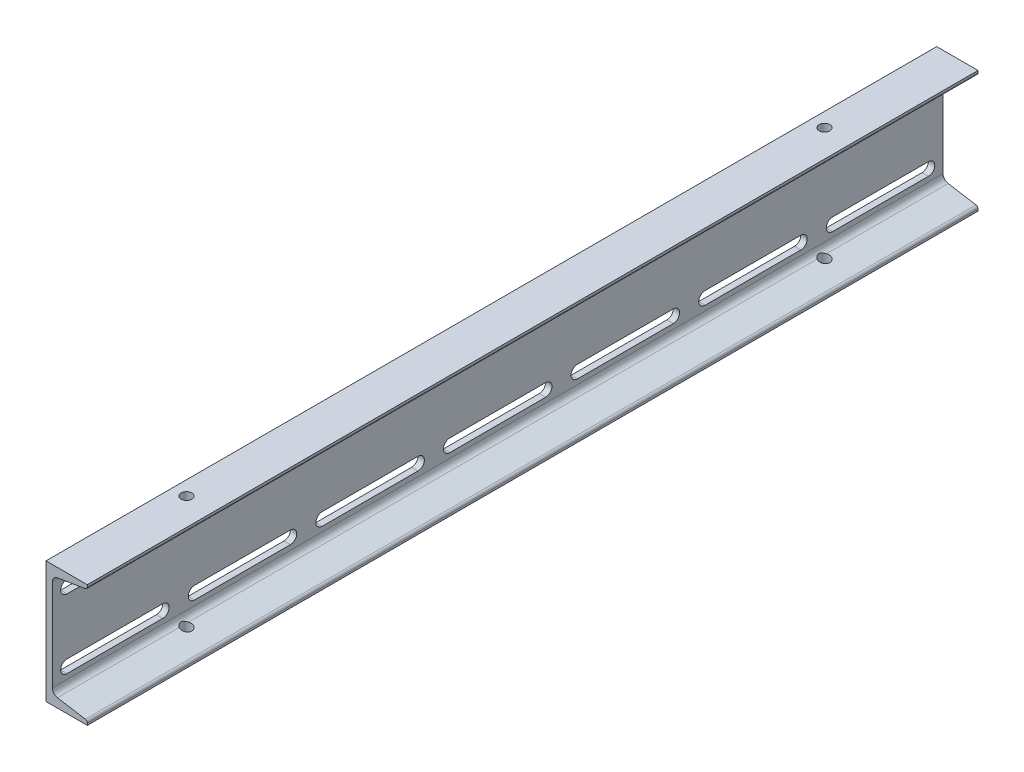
ISO-10303-21;
HEADER;
FILE_DESCRIPTION(('STEP AP214'),'2;1');
FILE_NAME('part.step','',(''),(''),'','','');
FILE_SCHEMA(('AUTOMOTIVE_DESIGN { 1 0 10303 214 1 1 1 1 }'));
ENDSEC;
DATA;
#1=APPLICATION_CONTEXT('core data for automotive mechanical design processes');
#2=APPLICATION_PROTOCOL_DEFINITION('international standard','automotive_design',2000,#1);
#3=PRODUCT_CONTEXT('',#1,'mechanical');
#4=PRODUCT('Part','Part','',(#3));
#5=PRODUCT_RELATED_PRODUCT_CATEGORY('part','',(#4));
#6=PRODUCT_DEFINITION_FORMATION('','',#4);
#7=PRODUCT_DEFINITION_CONTEXT('part definition',#1,'design');
#8=PRODUCT_DEFINITION('design','',#6,#7);
#9=PRODUCT_DEFINITION_SHAPE('','',#8);
#10=(LENGTH_UNIT() NAMED_UNIT(*) SI_UNIT(.MILLI.,.METRE.));
#11=(NAMED_UNIT(*) PLANE_ANGLE_UNIT() SI_UNIT($,.RADIAN.));
#12=(NAMED_UNIT(*) SI_UNIT($,.STERADIAN.) SOLID_ANGLE_UNIT());
#13=UNCERTAINTY_MEASURE_WITH_UNIT(LENGTH_MEASURE(1.E-05),#10,'distance_accuracy_value','');
#14=(GEOMETRIC_REPRESENTATION_CONTEXT(3) GLOBAL_UNCERTAINTY_ASSIGNED_CONTEXT((#13)) GLOBAL_UNIT_ASSIGNED_CONTEXT((#10,
#11,#12)) REPRESENTATION_CONTEXT('',''));
#15=CARTESIAN_POINT('',(0.,0.,0.));
#16=DIRECTION('',(0.,0.,1.));
#17=DIRECTION('',(1.,0.,0.));
#18=AXIS2_PLACEMENT_3D('',#15,#16,#17);
#19=CARTESIAN_POINT('',(-12.6835734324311,-76.2,557.000833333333));
#20=DIRECTION('',(0.,1.,0.));
#21=DIRECTION('',(-1.,0.,0.));
#22=AXIS2_PLACEMENT_3D('',#19,#20,#21);
#23=PLANE('',#22);
#24=CARTESIAN_POINT('',(4.97577656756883,-76.2,-398.991666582));
#25=DIRECTION('',(0.,1.,0.));
#26=DIRECTION('',(0.,0.,1.));
#27=AXIS2_PLACEMENT_3D('',#24,#25,#26);
#28=CIRCLE('',#27,6.74687499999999);
#29=CARTESIAN_POINT('',(4.97577656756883,-76.2,-392.244791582));
#30=VERTEX_POINT('',#29);
#31=EDGE_CURVE('E487',#30,#30,#28,.T.);
#32=ORIENTED_EDGE('',*,*,#31,.T.);
#33=EDGE_LOOP('',(#32));
#34=FACE_BOUND('',#33,.T.);
#35=CARTESIAN_POINT('',(4.97577656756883,-76.2,398.991666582));
#36=DIRECTION('',(0.,1.,0.));
#37=DIRECTION('',(0.,0.,1.));
#38=AXIS2_PLACEMENT_3D('',#35,#36,#37);
#39=CIRCLE('',#38,6.74687499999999);
#40=CARTESIAN_POINT('',(4.97577656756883,-76.2,405.738541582));
#41=VERTEX_POINT('',#40);
#42=EDGE_CURVE('E929',#41,#41,#39,.T.);
#43=ORIENTED_EDGE('',*,*,#42,.T.);
#44=EDGE_LOOP('',(#43));
#45=FACE_BOUND('',#44,.T.);
#46=DIRECTION('',(1.,0.,0.));
#47=VECTOR('',#46,1.);
#48=CARTESIAN_POINT('',(-12.6835734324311,-76.2,-557.000833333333));
#49=LINE('',#48,#47);
#50=CARTESIAN_POINT('',(-12.6835734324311,-76.2,-557.000833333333));
#51=VERTEX_POINT('',#50);
#52=CARTESIAN_POINT('',(38.9800265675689,-76.2,-557.000833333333));
#53=VERTEX_POINT('',#52);
#54=EDGE_CURVE('E555',#51,#53,#49,.T.);
#55=ORIENTED_EDGE('',*,*,#54,.T.);
#56=DIRECTION('',(0.,0.,-1.));
#57=VECTOR('',#56,1.);
#58=CARTESIAN_POINT('',(38.9800265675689,-76.2,557.000833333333));
#59=LINE('',#58,#57);
#60=CARTESIAN_POINT('',(38.9800265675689,-76.2,557.000833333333));
#61=VERTEX_POINT('',#60);
#62=EDGE_CURVE('E934',#61,#53,#59,.T.);
#63=ORIENTED_EDGE('',*,*,#62,.F.);
#64=DIRECTION('',(1.,0.,0.));
#65=VECTOR('',#64,1.);
#66=CARTESIAN_POINT('',(-12.6835734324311,-76.2,557.000833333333));
#67=LINE('',#66,#65);
#68=CARTESIAN_POINT('',(-12.6835734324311,-76.2,557.000833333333));
#69=VERTEX_POINT('',#68);
#70=EDGE_CURVE('E533',#69,#61,#67,.T.);
#71=ORIENTED_EDGE('',*,*,#70,.F.);
#72=DIRECTION('',(0.,0.,-1.));
#73=VECTOR('',#72,1.);
#74=CARTESIAN_POINT('',(-12.6835734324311,-76.2,557.000833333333));
#75=LINE('',#74,#73);
#76=EDGE_CURVE('E527',#69,#51,#75,.T.);
#77=ORIENTED_EDGE('',*,*,#76,.T.);
#78=EDGE_LOOP('',(#55,#63,#71,#77));
#79=FACE_BOUND('',#78,.T.);
#80=ADVANCED_FACE('F32',(#34,#45,#79),#23,.F.);
#81=CARTESIAN_POINT('',(38.9800265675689,-76.2,557.000833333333));
#82=DIRECTION('',(-1.,0.,0.));
#83=DIRECTION('',(0.,0.,1.));
#84=AXIS2_PLACEMENT_3D('',#81,#82,#83);
#85=PLANE('',#84);
#86=DIRECTION('',(0.,1.,0.));
#87=VECTOR('',#86,1.);
#88=CARTESIAN_POINT('',(38.9800265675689,-76.2,-557.000833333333));
#89=LINE('',#88,#87);
#90=CARTESIAN_POINT('',(38.9800265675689,-73.7107446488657,-557.000833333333));
#91=VERTEX_POINT('',#90);
#92=EDGE_CURVE('E553',#53,#91,#89,.T.);
#93=ORIENTED_EDGE('',*,*,#92,.T.);
#94=DIRECTION('',(0.,0.,-1.));
#95=VECTOR('',#94,1.);
#96=CARTESIAN_POINT('',(38.9800265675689,-73.7107446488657,557.000833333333));
#97=LINE('',#96,#95);
#98=CARTESIAN_POINT('',(38.9800265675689,-73.7107446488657,557.000833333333));
#99=VERTEX_POINT('',#98);
#100=EDGE_CURVE('E945',#99,#91,#97,.T.);
#101=ORIENTED_EDGE('',*,*,#100,.F.);
#102=DIRECTION('',(0.,1.,0.));
#103=VECTOR('',#102,1.);
#104=CARTESIAN_POINT('',(38.9800265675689,-76.2,557.000833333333));
#105=LINE('',#104,#103);
#106=EDGE_CURVE('E577',#61,#99,#105,.T.);
#107=ORIENTED_EDGE('',*,*,#106,.F.);
#108=ORIENTED_EDGE('',*,*,#62,.T.);
#109=EDGE_LOOP('',(#93,#101,#107,#108));
#110=FACE_BOUND('',#109,.T.);
#111=ADVANCED_FACE('F916',(#110),#85,.F.);
#112=CARTESIAN_POINT('',(35.9320265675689,-73.7107446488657,557.000833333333));
#113=DIRECTION('',(0.,0.,-1.));
#114=DIRECTION('',(-1.,0.,0.));
#115=AXIS2_PLACEMENT_3D('',#112,#113,#114);
#116=CYLINDRICAL_SURFACE('',#115,3.048);
#117=CARTESIAN_POINT('',(35.9320265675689,-73.7107446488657,-557.000833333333));
#118=DIRECTION('',(0.,0.,1.));
#119=DIRECTION('',(1.,0.,0.));
#120=AXIS2_PLACEMENT_3D('',#117,#118,#119);
#121=CIRCLE('',#120,3.048);
#122=CARTESIAN_POINT('',(36.4331502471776,-70.7042218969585,-557.000833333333));
#123=VERTEX_POINT('',#122);
#124=EDGE_CURVE('E551',#91,#123,#121,.T.);
#125=ORIENTED_EDGE('',*,*,#124,.T.);
#126=DIRECTION('',(0.,0.,-1.));
#127=VECTOR('',#126,1.);
#128=CARTESIAN_POINT('',(36.4331502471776,-70.7042218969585,557.000833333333));
#129=LINE('',#128,#127);
#130=CARTESIAN_POINT('',(36.4331502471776,-70.7042218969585,557.000833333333));
#131=VERTEX_POINT('',#130);
#132=EDGE_CURVE('E950',#131,#123,#129,.T.);
#133=ORIENTED_EDGE('',*,*,#132,.F.);
#134=CARTESIAN_POINT('',(35.9320265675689,-73.7107446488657,557.000833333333));
#135=DIRECTION('',(0.,0.,1.));
#136=DIRECTION('',(1.,0.,0.));
#137=AXIS2_PLACEMENT_3D('',#134,#135,#136);
#138=CIRCLE('',#137,3.048);
#139=EDGE_CURVE('E575',#99,#131,#138,.T.);
#140=ORIENTED_EDGE('',*,*,#139,.F.);
#141=ORIENTED_EDGE('',*,*,#100,.T.);
#142=EDGE_LOOP('',(#125,#133,#140,#141));
#143=FACE_BOUND('',#142,.T.);
#144=ADVANCED_FACE('F921',(#143),#116,.T.);
#145=CARTESIAN_POINT('',(1.65921736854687,-64.9081436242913,557.000833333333));
#146=DIRECTION('',(-0.164410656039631,-0.986391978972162,0.));
#147=DIRECTION('',(0.986391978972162,-0.164410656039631,0.));
#148=AXIS2_PLACEMENT_3D('',#145,#146,#147);
#149=PLANE('',#148);
#150=DIRECTION('',(0.,0.,-1.));
#151=VECTOR('',#150,1.);
#152=CARTESIAN_POINT('',(1.65921736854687,-64.9081436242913,557.000833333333));
#153=LINE('',#152,#151);
#154=CARTESIAN_POINT('',(1.65921736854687,-64.9081436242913,-404.867103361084));
#155=VERTEX_POINT('',#154);
#156=CARTESIAN_POINT('',(1.65921736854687,-64.9081436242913,-557.000833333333));
#157=VERTEX_POINT('',#156);
#158=EDGE_CURVE('E1282',#155,#157,#153,.T.);
#159=ORIENTED_EDGE('',*,*,#158,.F.);
#160=CARTESIAN_POINT('',(4.97577656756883,-65.4609438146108,-398.991666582));
#161=DIRECTION('',(-0.164410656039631,-0.986391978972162,0.));
#162=DIRECTION('',(-0.986391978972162,0.164410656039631,0.));
#163=AXIS2_PLACEMENT_3D('',#160,#161,#162);
#164=ELLIPSE('',#163,6.83995322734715,6.74687499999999);
#165=CARTESIAN_POINT('',(1.65921736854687,-64.9081436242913,-393.116229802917));
#166=VERTEX_POINT('',#165);
#167=EDGE_CURVE('E45',#155,#166,#164,.T.);
#168=ORIENTED_EDGE('',*,*,#167,.T.);
#169=CARTESIAN_POINT('',(1.65921736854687,-64.9081436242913,393.116229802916));
#170=VERTEX_POINT('',#169);
#171=EDGE_CURVE('E1278',#170,#166,#153,.T.);
#172=ORIENTED_EDGE('',*,*,#171,.F.);
#173=CARTESIAN_POINT('',(4.97577656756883,-65.4609438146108,398.991666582));
#174=DIRECTION('',(-0.164410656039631,-0.986391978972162,0.));
#175=DIRECTION('',(-0.986391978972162,0.164410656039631,0.));
#176=AXIS2_PLACEMENT_3D('',#173,#174,#175);
#177=ELLIPSE('',#176,6.83995322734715,6.74687499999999);
#178=CARTESIAN_POINT('',(1.65921736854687,-64.9081436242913,404.867103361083));
#179=VERTEX_POINT('',#178);
#180=EDGE_CURVE('E52',#170,#179,#177,.T.);
#181=ORIENTED_EDGE('',*,*,#180,.T.);
#182=CARTESIAN_POINT('',(1.65921736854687,-64.9081436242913,557.000833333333));
#183=VERTEX_POINT('',#182);
#184=EDGE_CURVE('E1281',#183,#179,#153,.T.);
#185=ORIENTED_EDGE('',*,*,#184,.F.);
#186=DIRECTION('',(-0.986391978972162,0.164410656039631,0.));
#187=VECTOR('',#186,1.);
#188=CARTESIAN_POINT('',(1.65921736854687,-64.9081436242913,557.000833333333));
#189=LINE('',#188,#187);
#190=EDGE_CURVE('E573',#131,#183,#189,.T.);
#191=ORIENTED_EDGE('',*,*,#190,.F.);
#192=ORIENTED_EDGE('',*,*,#132,.T.);
#193=DIRECTION('',(-0.986391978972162,0.164410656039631,0.));
#194=VECTOR('',#193,1.);
#195=CARTESIAN_POINT('',(1.65921736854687,-64.9081436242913,-557.000833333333));
#196=LINE('',#195,#194);
#197=EDGE_CURVE('E548',#123,#157,#196,.T.);
#198=ORIENTED_EDGE('',*,*,#197,.T.);
#199=EDGE_LOOP('',(#159,#168,#172,#181,#185,#191,#192,#198));
#200=FACE_BOUND('',#199,.T.);
#201=ADVANCED_FACE('F1270',(#200),#149,.F.);
#202=CARTESIAN_POINT('',(2.91202656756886,-57.3918367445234,557.000833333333));
#203=DIRECTION('',(0.,0.,-1.));
#204=DIRECTION('',(-1.,0.,0.));
#205=AXIS2_PLACEMENT_3D('',#202,#203,#204);
#206=CYLINDRICAL_SURFACE('',#205,7.62000000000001);
#207=ORIENTED_EDGE('',*,*,#171,.T.);
#208=CARTESIAN_POINT('',(1.65921736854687,-64.9081436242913,-393.116229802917));
#209=CARTESIAN_POINT('',(1.49303785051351,-64.8804642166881,-393.210016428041));
#210=CARTESIAN_POINT('',(1.33157235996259,-64.8478700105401,-393.310472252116));
#211=CARTESIAN_POINT('',(1.01905292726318,-64.7747016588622,-393.523547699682));
#212=CARTESIAN_POINT('',(0.867987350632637,-64.7341366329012,-393.63615335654));
#213=CARTESIAN_POINT('',(0.577268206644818,-64.6469246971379,-393.872248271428));
#214=CARTESIAN_POINT('',(0.437584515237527,-64.600294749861,-393.995706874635));
#215=CARTESIAN_POINT('',(0.16963100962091,-64.5026736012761,-394.25291295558));
#216=CARTESIAN_POINT('',(0.041364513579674,-64.4516811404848,-394.386663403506));
#217=CARTESIAN_POINT('',(-0.202829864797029,-64.3473827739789,-394.663129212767));
#218=CARTESIAN_POINT('',(-0.318804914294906,-64.294086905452,-394.805806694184));
#219=CARTESIAN_POINT('',(-0.538607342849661,-64.1868717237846,-395.09993052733));
#220=CARTESIAN_POINT('',(-0.64243515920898,-64.1329524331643,-395.251376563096));
#221=CARTESIAN_POINT('',(-0.935299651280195,-63.9730096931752,-395.71835637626));
#222=CARTESIAN_POINT('',(-1.10573592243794,-63.8687929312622,-396.046552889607));
#223=CARTESIAN_POINT('',(-1.37307128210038,-63.6945739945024,-396.686070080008));
#224=CARTESIAN_POINT('',(-1.47675217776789,-63.6218610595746,-396.993789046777));
#225=CARTESIAN_POINT('',(-1.59870136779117,-63.5335141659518,-397.467477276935));
#226=CARTESIAN_POINT('',(-1.63374650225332,-63.5075268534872,-397.627307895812));
#227=CARTESIAN_POINT('',(-1.69225003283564,-63.4636070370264,-397.950206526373));
#228=CARTESIAN_POINT('',(-1.71570869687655,-63.4456743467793,-398.113274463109));
#229=CARTESIAN_POINT('',(-1.75076257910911,-63.4187175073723,-398.442504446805));
#230=CARTESIAN_POINT('',(-1.76227930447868,-63.409752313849,-398.608679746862));
#231=CARTESIAN_POINT('',(-1.77296913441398,-63.4014343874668,-398.941672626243));
#232=CARTESIAN_POINT('',(-1.77214229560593,-63.4020816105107,-399.108490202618));
#233=CARTESIAN_POINT('',(-1.7581574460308,-63.4129543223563,-399.441351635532));
#234=CARTESIAN_POINT('',(-1.74499465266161,-63.4231835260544,-399.607395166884));
#235=CARTESIAN_POINT('',(-1.70657083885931,-63.4526568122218,-399.937251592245));
#236=CARTESIAN_POINT('',(-1.68130984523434,-63.4719008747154,-400.101064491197));
#237=CARTESIAN_POINT('',(-1.62189470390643,-63.5163119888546,-400.410688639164));
#238=CARTESIAN_POINT('',(-1.58874479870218,-63.5407906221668,-400.556793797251));
#239=CARTESIAN_POINT('',(-1.5131307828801,-63.5954290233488,-400.845499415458));
#240=CARTESIAN_POINT('',(-1.47066355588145,-63.6255906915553,-400.98809868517));
#241=CARTESIAN_POINT('',(-1.32978579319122,-63.7230665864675,-401.40994126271));
#242=CARTESIAN_POINT('',(-1.21789976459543,-63.7973712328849,-401.683226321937));
#243=CARTESIAN_POINT('',(-1.01439967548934,-63.9229442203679,-402.100943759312));
#244=CARTESIAN_POINT('',(-0.93360805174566,-63.9709937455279,-402.251829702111));
#245=CARTESIAN_POINT('',(-0.761095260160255,-64.0688444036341,-402.546633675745));
#246=CARTESIAN_POINT('',(-0.669372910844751,-64.1186457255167,-402.690550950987));
#247=CARTESIAN_POINT('',(-0.378402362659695,-64.2682366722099,-403.111026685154));
#248=CARTESIAN_POINT('',(-0.163135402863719,-64.3683540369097,-403.376749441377));
#249=CARTESIAN_POINT('',(0.186107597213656,-64.5086465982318,-403.746356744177));
#250=CARTESIAN_POINT('',(0.304993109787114,-64.5531810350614,-403.863222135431));
#251=CARTESIAN_POINT('',(0.551887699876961,-64.6382958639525,-404.088472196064));
#252=CARTESIAN_POINT('',(0.6798945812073,-64.6788772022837,-404.196858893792));
#253=CARTESIAN_POINT('',(0.944989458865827,-64.7548672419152,-404.404754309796));
#254=CARTESIAN_POINT('',(1.08210139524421,-64.7902614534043,-404.50423786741));
#255=CARTESIAN_POINT('',(1.36461418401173,-64.8544749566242,-404.69331405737));
#256=CARTESIAN_POINT('',(1.51002228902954,-64.8832883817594,-404.782897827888));
#257=CARTESIAN_POINT('',(1.65921736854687,-64.9081436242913,-404.867103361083));
#258=B_SPLINE_CURVE_WITH_KNOTS('',3,(#208,#209,#210,#211,#212,#213,#214,#215,#216,#217,#218,
#219,#220,#221,#222,#223,#224,#225,#226,#227,#228,#229,#230,#231,#232,#233,#234,#235,#236,#237,
#238,#239,#240,#241,#242,#243,#244,#245,#246,#247,#248,#249,#250,#251,#252,#253,#254,#255,#256,
#257),.UNSPECIFIED.,.F.,.F.,(4,2,2,2,2,2,2,2,2,2,2,2,2,2,2,2,2,2,2,2,2,2,2,2,4),(0.,
0.578048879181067,1.15544021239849,1.73125007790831,2.30722674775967,2.88090638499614,
3.45456536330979,4.60179639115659,5.59578399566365,6.09227666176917,6.58875784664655,
7.08848204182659,7.58820394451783,8.08811966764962,8.58803428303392,9.04298468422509,
9.49808748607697,10.4083023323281,10.9412079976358,11.474171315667,12.5385815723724,
13.0558743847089,13.5730430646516,14.0916299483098,14.6106773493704),.UNSPECIFIED.);
#259=EDGE_CURVE('E861',#166,#155,#258,.T.);
#260=ORIENTED_EDGE('',*,*,#259,.T.);
#261=ORIENTED_EDGE('',*,*,#158,.T.);
#262=CARTESIAN_POINT('',(2.91202656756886,-57.3918367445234,-557.000833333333));
#263=DIRECTION('',(0.,0.,-1.));
#264=DIRECTION('',(1.,0.,0.));
#265=AXIS2_PLACEMENT_3D('',#262,#263,#264);
#266=CIRCLE('',#265,7.62000000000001);
#267=CARTESIAN_POINT('',(-4.70797343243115,-57.3918367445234,-557.000833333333));
#268=VERTEX_POINT('',#267);
#269=EDGE_CURVE('E546',#157,#268,#266,.T.);
#270=ORIENTED_EDGE('',*,*,#269,.T.);
#271=DIRECTION('',(0.,0.,-1.));
#272=VECTOR('',#271,1.);
#273=CARTESIAN_POINT('',(-4.70797343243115,-57.3918367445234,557.000833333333));
#274=LINE('',#273,#272);
#275=CARTESIAN_POINT('',(-4.70797343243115,-57.3918367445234,557.000833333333));
#276=VERTEX_POINT('',#275);
#277=EDGE_CURVE('E507',#276,#268,#274,.T.);
#278=ORIENTED_EDGE('',*,*,#277,.F.);
#279=CARTESIAN_POINT('',(2.91202656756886,-57.3918367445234,557.000833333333));
#280=DIRECTION('',(0.,0.,-1.));
#281=DIRECTION('',(1.,0.,0.));
#282=AXIS2_PLACEMENT_3D('',#279,#280,#281);
#283=CIRCLE('',#282,7.62000000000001);
#284=EDGE_CURVE('E571',#183,#276,#283,.T.);
#285=ORIENTED_EDGE('',*,*,#284,.F.);
#286=ORIENTED_EDGE('',*,*,#184,.T.);
#287=CARTESIAN_POINT('',(1.65921736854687,-64.9081436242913,404.867103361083));
#288=CARTESIAN_POINT('',(1.49303785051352,-64.8804642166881,404.773316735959));
#289=CARTESIAN_POINT('',(1.3315723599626,-64.8478700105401,404.672860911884));
#290=CARTESIAN_POINT('',(1.01905292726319,-64.7747016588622,404.459785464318));
#291=CARTESIAN_POINT('',(0.867987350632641,-64.7341366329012,404.34717980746));
#292=CARTESIAN_POINT('',(0.577268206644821,-64.6469246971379,404.111084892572));
#293=CARTESIAN_POINT('',(0.43758451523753,-64.600294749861,403.987626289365));
#294=CARTESIAN_POINT('',(0.169631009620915,-64.5026736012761,403.73042020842));
#295=CARTESIAN_POINT('',(0.0413645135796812,-64.4516811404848,403.596669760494));
#296=CARTESIAN_POINT('',(-0.202829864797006,-64.3473827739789,403.320203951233));
#297=CARTESIAN_POINT('',(-0.31880491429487,-64.294086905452,403.177526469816));
#298=CARTESIAN_POINT('',(-0.538607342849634,-64.1868717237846,402.88340263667));
#299=CARTESIAN_POINT('',(-0.642435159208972,-64.1329524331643,402.731956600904));
#300=CARTESIAN_POINT('',(-0.935299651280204,-63.9730096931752,402.26497678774));
#301=CARTESIAN_POINT('',(-1.10573592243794,-63.8687929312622,401.936780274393));
#302=CARTESIAN_POINT('',(-1.37307128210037,-63.6945739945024,401.297263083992));
#303=CARTESIAN_POINT('',(-1.47675217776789,-63.6218610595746,400.989544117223));
#304=CARTESIAN_POINT('',(-1.59870136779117,-63.5335141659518,400.515855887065));
#305=CARTESIAN_POINT('',(-1.63374650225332,-63.5075268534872,400.356025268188));
#306=CARTESIAN_POINT('',(-1.69225003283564,-63.4636070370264,400.033126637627));
#307=CARTESIAN_POINT('',(-1.71570869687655,-63.4456743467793,399.870058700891));
#308=CARTESIAN_POINT('',(-1.75076257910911,-63.4187175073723,399.540828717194));
#309=CARTESIAN_POINT('',(-1.76227930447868,-63.4097523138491,399.374653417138));
#310=CARTESIAN_POINT('',(-1.77296913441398,-63.4014343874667,399.041660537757));
#311=CARTESIAN_POINT('',(-1.77214229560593,-63.4020816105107,398.874842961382));
#312=CARTESIAN_POINT('',(-1.7581574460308,-63.4129543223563,398.541981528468));
#313=CARTESIAN_POINT('',(-1.74499465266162,-63.4231835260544,398.375937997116));
#314=CARTESIAN_POINT('',(-1.70657083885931,-63.4526568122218,398.046081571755));
#315=CARTESIAN_POINT('',(-1.68130984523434,-63.4719008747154,397.882268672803));
#316=CARTESIAN_POINT('',(-1.62189470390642,-63.5163119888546,397.572644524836));
#317=CARTESIAN_POINT('',(-1.58874479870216,-63.5407906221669,397.426539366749));
#318=CARTESIAN_POINT('',(-1.51313078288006,-63.5954290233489,397.137833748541));
#319=CARTESIAN_POINT('',(-1.47066355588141,-63.6255906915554,396.99523447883));
#320=CARTESIAN_POINT('',(-1.32978579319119,-63.7230665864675,396.573391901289));
#321=CARTESIAN_POINT('',(-1.21789976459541,-63.7973712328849,396.300106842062));
#322=CARTESIAN_POINT('',(-1.01439967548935,-63.9229442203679,395.882389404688));
#323=CARTESIAN_POINT('',(-0.93360805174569,-63.9709937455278,395.731503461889));
#324=CARTESIAN_POINT('',(-0.761095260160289,-64.0688444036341,395.436699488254));
#325=CARTESIAN_POINT('',(-0.669372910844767,-64.1186457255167,395.292782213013));
#326=CARTESIAN_POINT('',(-0.378402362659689,-64.26823667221,394.872306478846));
#327=CARTESIAN_POINT('',(-0.163135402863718,-64.3683540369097,394.606583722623));
#328=CARTESIAN_POINT('',(0.186107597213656,-64.5086465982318,394.236976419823));
#329=CARTESIAN_POINT('',(0.304993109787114,-64.5531810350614,394.120111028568));
#330=CARTESIAN_POINT('',(0.551887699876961,-64.6382958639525,393.894860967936));
#331=CARTESIAN_POINT('',(0.679894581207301,-64.6788772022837,393.786474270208));
#332=CARTESIAN_POINT('',(0.944989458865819,-64.7548672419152,393.578578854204));
#333=CARTESIAN_POINT('',(1.08210139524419,-64.7902614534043,393.47909529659));
#334=CARTESIAN_POINT('',(1.3646141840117,-64.8544749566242,393.29001910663));
#335=CARTESIAN_POINT('',(1.51002228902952,-64.8832883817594,393.200435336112));
#336=CARTESIAN_POINT('',(1.65921736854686,-64.9081436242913,393.116229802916));
#337=B_SPLINE_CURVE_WITH_KNOTS('',3,(#287,#288,#289,#290,#291,#292,#293,#294,#295,#296,#297,
#298,#299,#300,#301,#302,#303,#304,#305,#306,#307,#308,#309,#310,#311,#312,#313,#314,#315,#316,
#317,#318,#319,#320,#321,#322,#323,#324,#325,#326,#327,#328,#329,#330,#331,#332,#333,#334,#335,
#336),.UNSPECIFIED.,.F.,.F.,(4,2,2,2,2,2,2,2,2,2,2,2,2,2,2,2,2,2,2,2,2,2,2,2,4),(0.,
0.578048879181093,1.15544021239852,1.73125007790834,2.30722674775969,2.88090638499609,
3.45456536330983,4.60179639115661,5.59578399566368,6.0922766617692,6.58875784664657,
7.08848204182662,7.5882039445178,8.08811966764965,8.58803428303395,9.0429846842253,
9.49808748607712,10.4083023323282,10.9412079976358,11.474171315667,12.5385815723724,
13.055874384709,13.5730430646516,14.0916299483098,14.6106773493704),.UNSPECIFIED.);
#338=EDGE_CURVE('E498',#179,#170,#337,.T.);
#339=ORIENTED_EDGE('',*,*,#338,.T.);
#340=EDGE_LOOP('',(#207,#260,#261,#270,#278,#285,#286,#339));
#341=FACE_BOUND('',#340,.T.);
#342=ADVANCED_FACE('F876',(#341),#206,.F.);
#343=CARTESIAN_POINT('',(-4.70797343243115,57.3918367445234,557.000833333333));
#344=DIRECTION('',(-1.,0.,0.));
#345=DIRECTION('',(0.,0.,1.));
#346=AXIS2_PLACEMENT_3D('',#343,#344,#345);
#347=PLANE('',#346);
#348=DIRECTION('',(0.,0.,-1.));
#349=VECTOR('',#348,1.);
#350=CARTESIAN_POINT('',(-4.70797343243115,-51.1175,219.498333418));
#351=LINE('',#350,#349);
#352=CARTESIAN_POINT('',(-4.70797343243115,-51.1174999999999,219.498333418));
#353=VERTEX_POINT('',#352);
#354=CARTESIAN_POINT('',(-4.70797343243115,-51.1175,99.695));
#355=VERTEX_POINT('',#354);
#356=EDGE_CURVE('E717',#353,#355,#351,.T.);
#357=ORIENTED_EDGE('',*,*,#356,.F.);
#358=CARTESIAN_POINT('',(-4.70797343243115,-43.18,219.498333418));
#359=DIRECTION('',(1.,0.,0.));
#360=DIRECTION('',(0.,0.,-1.));
#361=AXIS2_PLACEMENT_3D('',#358,#359,#360);
#362=CIRCLE('',#361,7.93749999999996);
#363=CARTESIAN_POINT('',(-4.70797343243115,-35.2425,219.498333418));
#364=VERTEX_POINT('',#363);
#365=EDGE_CURVE('E691',#364,#353,#362,.T.);
#366=ORIENTED_EDGE('',*,*,#365,.F.);
#367=DIRECTION('',(0.,0.,1.));
#368=VECTOR('',#367,1.);
#369=CARTESIAN_POINT('',(-4.70797343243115,-35.2425,219.498333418));
#370=LINE('',#369,#368);
#371=CARTESIAN_POINT('',(-4.70797343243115,-35.2425,99.695));
#372=VERTEX_POINT('',#371);
#373=EDGE_CURVE('E707',#372,#364,#370,.T.);
#374=ORIENTED_EDGE('',*,*,#373,.F.);
#375=CARTESIAN_POINT('',(-4.70797343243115,-43.18,99.695));
#376=DIRECTION('',(1.,0.,0.));
#377=DIRECTION('',(0.,0.,-1.));
#378=AXIS2_PLACEMENT_3D('',#375,#376,#377);
#379=CIRCLE('',#378,7.9375);
#380=EDGE_CURVE('E714',#355,#372,#379,.T.);
#381=ORIENTED_EDGE('',*,*,#380,.F.);
#382=EDGE_LOOP('',(#357,#366,#374,#381));
#383=FACE_BOUND('',#382,.T.);
#384=DIRECTION('',(0.,0.,-1.));
#385=VECTOR('',#384,1.);
#386=CARTESIAN_POINT('',(-4.70797343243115,35.2425,59.9016668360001));
#387=LINE('',#386,#385);
#388=CARTESIAN_POINT('',(-4.70797343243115,35.2424999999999,59.9016668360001));
#389=VERTEX_POINT('',#388);
#390=CARTESIAN_POINT('',(-4.70797343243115,35.2425,-59.9016665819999));
#391=VERTEX_POINT('',#390);
#392=EDGE_CURVE('E697',#389,#391,#387,.T.);
#393=ORIENTED_EDGE('',*,*,#392,.F.);
#394=CARTESIAN_POINT('',(-4.70797343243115,43.18,59.9016668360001));
#395=DIRECTION('',(1.,0.,0.));
#396=DIRECTION('',(0.,0.,-1.));
#397=AXIS2_PLACEMENT_3D('',#394,#395,#396);
#398=CIRCLE('',#397,7.93750000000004);
#399=CARTESIAN_POINT('',(-4.70797343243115,51.1175,59.9016668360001));
#400=VERTEX_POINT('',#399);
#401=EDGE_CURVE('E700',#400,#389,#398,.T.);
#402=ORIENTED_EDGE('',*,*,#401,.F.);
#403=DIRECTION('',(0.,0.,1.));
#404=VECTOR('',#403,1.);
#405=CARTESIAN_POINT('',(-4.70797343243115,51.1175,59.9016668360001));
#406=LINE('',#405,#404);
#407=CARTESIAN_POINT('',(-4.70797343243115,51.1175,-59.9016665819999));
#408=VERTEX_POINT('',#407);
#409=EDGE_CURVE('E685',#408,#400,#406,.T.);
#410=ORIENTED_EDGE('',*,*,#409,.F.);
#411=CARTESIAN_POINT('',(-4.70797343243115,43.18,-59.9016665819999));
#412=DIRECTION('',(1.,0.,0.));
#413=DIRECTION('',(0.,0.,-1.));
#414=AXIS2_PLACEMENT_3D('',#411,#412,#413);
#415=CIRCLE('',#414,7.9375);
#416=EDGE_CURVE('E694',#391,#408,#415,.T.);
#417=ORIENTED_EDGE('',*,*,#416,.F.);
#418=EDGE_LOOP('',(#393,#402,#410,#417));
#419=FACE_BOUND('',#418,.T.);
#420=DIRECTION('',(0.,0.,-1.));
#421=VECTOR('',#420,1.);
#422=CARTESIAN_POINT('',(-4.70797343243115,-51.1175,59.9016668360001));
#423=LINE('',#422,#421);
#424=CARTESIAN_POINT('',(-4.70797343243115,-51.1175,59.9016668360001));
#425=VERTEX_POINT('',#424);
#426=CARTESIAN_POINT('',(-4.70797343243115,-51.1175,-59.9016665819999));
#427=VERTEX_POINT('',#426);
#428=EDGE_CURVE('E757',#425,#427,#423,.T.);
#429=ORIENTED_EDGE('',*,*,#428,.F.);
#430=CARTESIAN_POINT('',(-4.70797343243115,-43.18,59.9016668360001));
#431=DIRECTION('',(1.,0.,0.));
#432=DIRECTION('',(0.,0.,-1.));
#433=AXIS2_PLACEMENT_3D('',#430,#431,#432);
#434=CIRCLE('',#433,7.93749999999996);
#435=CARTESIAN_POINT('',(-4.70797343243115,-35.2425,59.9016668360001));
#436=VERTEX_POINT('',#435);
#437=EDGE_CURVE('E731',#436,#425,#434,.T.);
#438=ORIENTED_EDGE('',*,*,#437,.F.);
#439=DIRECTION('',(0.,0.,1.));
#440=VECTOR('',#439,1.);
#441=CARTESIAN_POINT('',(-4.70797343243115,-35.2425,59.9016668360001));
#442=LINE('',#441,#440);
#443=CARTESIAN_POINT('',(-4.70797343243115,-35.2425,-59.9016665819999));
#444=VERTEX_POINT('',#443);
#445=EDGE_CURVE('E747',#444,#436,#442,.T.);
#446=ORIENTED_EDGE('',*,*,#445,.F.);
#447=CARTESIAN_POINT('',(-4.70797343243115,-43.18,-59.9016665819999));
#448=DIRECTION('',(1.,0.,0.));
#449=DIRECTION('',(0.,0.,-1.));
#450=AXIS2_PLACEMENT_3D('',#447,#448,#449);
#451=CIRCLE('',#450,7.9375);
#452=EDGE_CURVE('E754',#427,#444,#451,.T.);
#453=ORIENTED_EDGE('',*,*,#452,.F.);
#454=EDGE_LOOP('',(#429,#438,#446,#453));
#455=FACE_BOUND('',#454,.T.);
#456=DIRECTION('',(0.,0.,-1.));
#457=VECTOR('',#456,1.);
#458=CARTESIAN_POINT('',(-4.70797343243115,35.2425,-99.6949997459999));
#459=LINE('',#458,#457);
#460=CARTESIAN_POINT('',(-4.70797343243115,35.2424999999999,-99.6949997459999));
#461=VERTEX_POINT('',#460);
#462=CARTESIAN_POINT('',(-4.70797343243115,35.2425,-219.498333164));
#463=VERTEX_POINT('',#462);
#464=EDGE_CURVE('E737',#461,#463,#459,.T.);
#465=ORIENTED_EDGE('',*,*,#464,.F.);
#466=CARTESIAN_POINT('',(-4.70797343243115,43.18,-99.6949997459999));
#467=DIRECTION('',(1.,0.,0.));
#468=DIRECTION('',(0.,0.,-1.));
#469=AXIS2_PLACEMENT_3D('',#466,#467,#468);
#470=CIRCLE('',#469,7.93750000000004);
#471=CARTESIAN_POINT('',(-4.70797343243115,51.1175,-99.6949997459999));
#472=VERTEX_POINT('',#471);
#473=EDGE_CURVE('E740',#472,#461,#470,.T.);
#474=ORIENTED_EDGE('',*,*,#473,.F.);
#475=DIRECTION('',(0.,0.,1.));
#476=VECTOR('',#475,1.);
#477=CARTESIAN_POINT('',(-4.70797343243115,51.1175,-99.6949997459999));
#478=LINE('',#477,#476);
#479=CARTESIAN_POINT('',(-4.70797343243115,51.1175,-219.498333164));
#480=VERTEX_POINT('',#479);
#481=EDGE_CURVE('E725',#480,#472,#478,.T.);
#482=ORIENTED_EDGE('',*,*,#481,.F.);
#483=CARTESIAN_POINT('',(-4.70797343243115,43.18,-219.498333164));
#484=DIRECTION('',(1.,0.,0.));
#485=DIRECTION('',(0.,0.,-1.));
#486=AXIS2_PLACEMENT_3D('',#483,#484,#485);
#487=CIRCLE('',#486,7.9375);
#488=EDGE_CURVE('E734',#463,#480,#487,.T.);
#489=ORIENTED_EDGE('',*,*,#488,.F.);
#490=EDGE_LOOP('',(#465,#474,#482,#489));
#491=FACE_BOUND('',#490,.T.);
#492=DIRECTION('',(0.,0.,-1.));
#493=VECTOR('',#492,1.);
#494=CARTESIAN_POINT('',(-4.70797343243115,35.2425,379.095));
#495=LINE('',#494,#493);
#496=CARTESIAN_POINT('',(-4.70797343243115,35.2424999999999,379.095));
#497=VERTEX_POINT('',#496);
#498=CARTESIAN_POINT('',(-4.70797343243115,35.2425,259.291666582));
#499=VERTEX_POINT('',#498);
#500=EDGE_CURVE('E637',#497,#499,#495,.T.);
#501=ORIENTED_EDGE('',*,*,#500,.F.);
#502=CARTESIAN_POINT('',(-4.70797343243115,43.18,379.095));
#503=DIRECTION('',(1.,0.,0.));
#504=DIRECTION('',(0.,0.,-1.));
#505=AXIS2_PLACEMENT_3D('',#502,#503,#504);
#506=CIRCLE('',#505,7.93750000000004);
#507=CARTESIAN_POINT('',(-4.70797343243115,51.1175,379.095));
#508=VERTEX_POINT('',#507);
#509=EDGE_CURVE('E611',#508,#497,#506,.T.);
#510=ORIENTED_EDGE('',*,*,#509,.F.);
#511=DIRECTION('',(0.,0.,1.));
#512=VECTOR('',#511,1.);
#513=CARTESIAN_POINT('',(-4.70797343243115,51.1175,379.095));
#514=LINE('',#513,#512);
#515=CARTESIAN_POINT('',(-4.70797343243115,51.1175,259.291666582));
#516=VERTEX_POINT('',#515);
#517=EDGE_CURVE('E627',#516,#508,#514,.T.);
#518=ORIENTED_EDGE('',*,*,#517,.F.);
#519=CARTESIAN_POINT('',(-4.70797343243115,43.18,259.291666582));
#520=DIRECTION('',(1.,0.,0.));
#521=DIRECTION('',(0.,0.,-1.));
#522=AXIS2_PLACEMENT_3D('',#519,#520,#521);
#523=CIRCLE('',#522,7.9375);
#524=EDGE_CURVE('E634',#499,#516,#523,.T.);
#525=ORIENTED_EDGE('',*,*,#524,.F.);
#526=EDGE_LOOP('',(#501,#510,#518,#525));
#527=FACE_BOUND('',#526,.T.);
#528=DIRECTION('',(0.,0.,-1.));
#529=VECTOR('',#528,1.);
#530=CARTESIAN_POINT('',(-4.70797343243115,-51.1175,538.691666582));
#531=LINE('',#530,#529);
#532=CARTESIAN_POINT('',(-4.70797343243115,-51.1175,538.691666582));
#533=VERTEX_POINT('',#532);
#534=CARTESIAN_POINT('',(-4.70797343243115,-51.1175,418.888333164));
#535=VERTEX_POINT('',#534);
#536=EDGE_CURVE('E617',#533,#535,#531,.T.);
#537=ORIENTED_EDGE('',*,*,#536,.F.);
#538=CARTESIAN_POINT('',(-4.70797343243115,-43.18,538.691666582));
#539=DIRECTION('',(1.,0.,0.));
#540=DIRECTION('',(0.,0.,-1.));
#541=AXIS2_PLACEMENT_3D('',#538,#539,#540);
#542=CIRCLE('',#541,7.93749999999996);
#543=CARTESIAN_POINT('',(-4.70797343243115,-35.2425,538.691666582));
#544=VERTEX_POINT('',#543);
#545=EDGE_CURVE('E620',#544,#533,#542,.T.);
#546=ORIENTED_EDGE('',*,*,#545,.F.);
#547=DIRECTION('',(0.,0.,1.));
#548=VECTOR('',#547,1.);
#549=CARTESIAN_POINT('',(-4.70797343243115,-35.2425,538.691666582));
#550=LINE('',#549,#548);
#551=CARTESIAN_POINT('',(-4.70797343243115,-35.2425,418.888333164));
#552=VERTEX_POINT('',#551);
#553=EDGE_CURVE('E605',#552,#544,#550,.T.);
#554=ORIENTED_EDGE('',*,*,#553,.F.);
#555=CARTESIAN_POINT('',(-4.70797343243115,-43.18,418.888333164));
#556=DIRECTION('',(1.,0.,0.));
#557=DIRECTION('',(0.,0.,-1.));
#558=AXIS2_PLACEMENT_3D('',#555,#556,#557);
#559=CIRCLE('',#558,7.9375);
#560=EDGE_CURVE('E614',#535,#552,#559,.T.);
#561=ORIENTED_EDGE('',*,*,#560,.F.);
#562=EDGE_LOOP('',(#537,#546,#554,#561));
#563=FACE_BOUND('',#562,.T.);
#564=DIRECTION('',(0.,0.,-1.));
#565=VECTOR('',#564,1.);
#566=CARTESIAN_POINT('',(-4.70797343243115,-51.1175,379.095));
#567=LINE('',#566,#565);
#568=CARTESIAN_POINT('',(-4.70797343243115,-51.1175,379.095));
#569=VERTEX_POINT('',#568);
#570=CARTESIAN_POINT('',(-4.70797343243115,-51.1175,259.291666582));
#571=VERTEX_POINT('',#570);
#572=EDGE_CURVE('E677',#569,#571,#567,.T.);
#573=ORIENTED_EDGE('',*,*,#572,.F.);
#574=CARTESIAN_POINT('',(-4.70797343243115,-43.18,379.095));
#575=DIRECTION('',(1.,0.,0.));
#576=DIRECTION('',(0.,0.,-1.));
#577=AXIS2_PLACEMENT_3D('',#574,#575,#576);
#578=CIRCLE('',#577,7.93749999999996);
#579=CARTESIAN_POINT('',(-4.70797343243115,-35.2425,379.095));
#580=VERTEX_POINT('',#579);
#581=EDGE_CURVE('E651',#580,#569,#578,.T.);
#582=ORIENTED_EDGE('',*,*,#581,.F.);
#583=DIRECTION('',(0.,0.,1.));
#584=VECTOR('',#583,1.);
#585=CARTESIAN_POINT('',(-4.70797343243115,-35.2425,379.095));
#586=LINE('',#585,#584);
#587=CARTESIAN_POINT('',(-4.70797343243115,-35.2425,259.291666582));
#588=VERTEX_POINT('',#587);
#589=EDGE_CURVE('E667',#588,#580,#586,.T.);
#590=ORIENTED_EDGE('',*,*,#589,.F.);
#591=CARTESIAN_POINT('',(-4.70797343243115,-43.18,259.291666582));
#592=DIRECTION('',(1.,0.,0.));
#593=DIRECTION('',(0.,0.,-1.));
#594=AXIS2_PLACEMENT_3D('',#591,#592,#593);
#595=CIRCLE('',#594,7.9375);
#596=EDGE_CURVE('E674',#571,#588,#595,.T.);
#597=ORIENTED_EDGE('',*,*,#596,.F.);
#598=EDGE_LOOP('',(#573,#582,#590,#597));
#599=FACE_BOUND('',#598,.T.);
#600=DIRECTION('',(0.,0.,-1.));
#601=VECTOR('',#600,1.);
#602=CARTESIAN_POINT('',(-4.70797343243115,35.2425,219.498333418));
#603=LINE('',#602,#601);
#604=CARTESIAN_POINT('',(-4.70797343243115,35.2424999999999,219.498333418));
#605=VERTEX_POINT('',#604);
#606=CARTESIAN_POINT('',(-4.70797343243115,35.2425,99.695));
#607=VERTEX_POINT('',#606);
#608=EDGE_CURVE('E657',#605,#607,#603,.T.);
#609=ORIENTED_EDGE('',*,*,#608,.F.);
#610=CARTESIAN_POINT('',(-4.70797343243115,43.18,219.498333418));
#611=DIRECTION('',(1.,0.,0.));
#612=DIRECTION('',(0.,0.,-1.));
#613=AXIS2_PLACEMENT_3D('',#610,#611,#612);
#614=CIRCLE('',#613,7.93750000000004);
#615=CARTESIAN_POINT('',(-4.70797343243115,51.1175,219.498333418));
#616=VERTEX_POINT('',#615);
#617=EDGE_CURVE('E660',#616,#605,#614,.T.);
#618=ORIENTED_EDGE('',*,*,#617,.F.);
#619=DIRECTION('',(0.,0.,1.));
#620=VECTOR('',#619,1.);
#621=CARTESIAN_POINT('',(-4.70797343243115,51.1175,219.498333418));
#622=LINE('',#621,#620);
#623=CARTESIAN_POINT('',(-4.70797343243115,51.1175,99.695));
#624=VERTEX_POINT('',#623);
#625=EDGE_CURVE('E645',#624,#616,#622,.T.);
#626=ORIENTED_EDGE('',*,*,#625,.F.);
#627=CARTESIAN_POINT('',(-4.70797343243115,43.18,99.695));
#628=DIRECTION('',(1.,0.,0.));
#629=DIRECTION('',(0.,0.,-1.));
#630=AXIS2_PLACEMENT_3D('',#627,#628,#629);
#631=CIRCLE('',#630,7.9375);
#632=EDGE_CURVE('E654',#607,#624,#631,.T.);
#633=ORIENTED_EDGE('',*,*,#632,.F.);
#634=EDGE_LOOP('',(#609,#618,#626,#633));
#635=FACE_BOUND('',#634,.T.);
#636=DIRECTION('',(0.,0.,-1.));
#637=VECTOR('',#636,1.);
#638=CARTESIAN_POINT('',(-4.70797343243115,-51.1175,-418.88833291));
#639=LINE('',#638,#637);
#640=CARTESIAN_POINT('',(-4.70797343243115,-51.1175,-418.88833291));
#641=VERTEX_POINT('',#640);
#642=CARTESIAN_POINT('',(-4.70797343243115,-51.1175,-538.691666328));
#643=VERTEX_POINT('',#642);
#644=EDGE_CURVE('E855',#641,#643,#639,.T.);
#645=ORIENTED_EDGE('',*,*,#644,.F.);
#646=CARTESIAN_POINT('',(-4.70797343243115,-43.18,-418.88833291));
#647=DIRECTION('',(1.,0.,0.));
#648=DIRECTION('',(0.,0.,-1.));
#649=AXIS2_PLACEMENT_3D('',#646,#647,#648);
#650=CIRCLE('',#649,7.93749999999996);
#651=CARTESIAN_POINT('',(-4.70797343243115,-35.2425,-418.88833291));
#652=VERTEX_POINT('',#651);
#653=EDGE_CURVE('E858',#652,#641,#650,.T.);
#654=ORIENTED_EDGE('',*,*,#653,.F.);
#655=DIRECTION('',(0.,0.,1.));
#656=VECTOR('',#655,1.);
#657=CARTESIAN_POINT('',(-4.70797343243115,-35.2425,-418.88833291));
#658=LINE('',#657,#656);
#659=CARTESIAN_POINT('',(-4.70797343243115,-35.2425,-538.691666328));
#660=VERTEX_POINT('',#659);
#661=EDGE_CURVE('E845',#660,#652,#658,.T.);
#662=ORIENTED_EDGE('',*,*,#661,.F.);
#663=CARTESIAN_POINT('',(-4.70797343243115,-43.18,-538.691666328));
#664=DIRECTION('',(1.,0.,0.));
#665=DIRECTION('',(0.,0.,-1.));
#666=AXIS2_PLACEMENT_3D('',#663,#664,#665);
#667=CIRCLE('',#666,7.9375);
#668=EDGE_CURVE('E852',#643,#660,#667,.T.);
#669=ORIENTED_EDGE('',*,*,#668,.F.);
#670=EDGE_LOOP('',(#645,#654,#662,#669));
#671=FACE_BOUND('',#670,.T.);
#672=DIRECTION('',(0.,0.,-1.));
#673=VECTOR('',#672,1.);
#674=CARTESIAN_POINT('',(-4.70797343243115,-51.1175,-99.6949997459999));
#675=LINE('',#674,#673);
#676=CARTESIAN_POINT('',(-4.70797343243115,-51.1175,-99.6949997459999));
#677=VERTEX_POINT('',#676);
#678=CARTESIAN_POINT('',(-4.70797343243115,-51.1175,-219.498333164));
#679=VERTEX_POINT('',#678);
#680=EDGE_CURVE('E797',#677,#679,#675,.T.);
#681=ORIENTED_EDGE('',*,*,#680,.F.);
#682=CARTESIAN_POINT('',(-4.70797343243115,-43.18,-99.6949997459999));
#683=DIRECTION('',(1.,0.,0.));
#684=DIRECTION('',(0.,0.,-1.));
#685=AXIS2_PLACEMENT_3D('',#682,#683,#684);
#686=CIRCLE('',#685,7.93749999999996);
#687=CARTESIAN_POINT('',(-4.70797343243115,-35.2425,-99.6949997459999));
#688=VERTEX_POINT('',#687);
#689=EDGE_CURVE('E771',#688,#677,#686,.T.);
#690=ORIENTED_EDGE('',*,*,#689,.F.);
#691=DIRECTION('',(0.,0.,1.));
#692=VECTOR('',#691,1.);
#693=CARTESIAN_POINT('',(-4.70797343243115,-35.2425,-99.6949997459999));
#694=LINE('',#693,#692);
#695=CARTESIAN_POINT('',(-4.70797343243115,-35.2425,-219.498333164));
#696=VERTEX_POINT('',#695);
#697=EDGE_CURVE('E787',#696,#688,#694,.T.);
#698=ORIENTED_EDGE('',*,*,#697,.F.);
#699=CARTESIAN_POINT('',(-4.70797343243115,-43.18,-219.498333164));
#700=DIRECTION('',(1.,0.,0.));
#701=DIRECTION('',(0.,0.,-1.));
#702=AXIS2_PLACEMENT_3D('',#699,#700,#701);
#703=CIRCLE('',#702,7.9375);
#704=EDGE_CURVE('E794',#679,#696,#703,.T.);
#705=ORIENTED_EDGE('',*,*,#704,.F.);
#706=EDGE_LOOP('',(#681,#690,#698,#705));
#707=FACE_BOUND('',#706,.T.);
#708=DIRECTION('',(0.,0.,-1.));
#709=VECTOR('',#708,1.);
#710=CARTESIAN_POINT('',(-4.70797343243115,35.2425,-259.291666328));
#711=LINE('',#710,#709);
#712=CARTESIAN_POINT('',(-4.70797343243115,35.2424999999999,-259.291666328));
#713=VERTEX_POINT('',#712);
#714=CARTESIAN_POINT('',(-4.70797343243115,35.2425,-379.094999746));
#715=VERTEX_POINT('',#714);
#716=EDGE_CURVE('E777',#713,#715,#711,.T.);
#717=ORIENTED_EDGE('',*,*,#716,.F.);
#718=CARTESIAN_POINT('',(-4.70797343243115,43.18,-259.291666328));
#719=DIRECTION('',(1.,0.,0.));
#720=DIRECTION('',(0.,0.,-1.));
#721=AXIS2_PLACEMENT_3D('',#718,#719,#720);
#722=CIRCLE('',#721,7.93750000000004);
#723=CARTESIAN_POINT('',(-4.70797343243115,51.1175,-259.291666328));
#724=VERTEX_POINT('',#723);
#725=EDGE_CURVE('E780',#724,#713,#722,.T.);
#726=ORIENTED_EDGE('',*,*,#725,.F.);
#727=DIRECTION('',(0.,0.,1.));
#728=VECTOR('',#727,1.);
#729=CARTESIAN_POINT('',(-4.70797343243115,51.1175,-259.291666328));
#730=LINE('',#729,#728);
#731=CARTESIAN_POINT('',(-4.70797343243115,51.1175,-379.094999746));
#732=VERTEX_POINT('',#731);
#733=EDGE_CURVE('E765',#732,#724,#730,.T.);
#734=ORIENTED_EDGE('',*,*,#733,.F.);
#735=CARTESIAN_POINT('',(-4.70797343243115,43.18,-379.094999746));
#736=DIRECTION('',(1.,0.,0.));
#737=DIRECTION('',(0.,0.,-1.));
#738=AXIS2_PLACEMENT_3D('',#735,#736,#737);
#739=CIRCLE('',#738,7.9375);
#740=EDGE_CURVE('E774',#715,#732,#739,.T.);
#741=ORIENTED_EDGE('',*,*,#740,.F.);
#742=EDGE_LOOP('',(#717,#726,#734,#741));
#743=FACE_BOUND('',#742,.T.);
#744=DIRECTION('',(0.,0.,-1.));
#745=VECTOR('',#744,1.);
#746=CARTESIAN_POINT('',(-4.70797343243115,-51.1175,-259.291666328));
#747=LINE('',#746,#745);
#748=CARTESIAN_POINT('',(-4.70797343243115,-51.1174999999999,-259.291666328));
#749=VERTEX_POINT('',#748);
#750=CARTESIAN_POINT('',(-4.70797343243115,-51.1175,-379.094999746));
#751=VERTEX_POINT('',#750);
#752=EDGE_CURVE('E837',#749,#751,#747,.T.);
#753=ORIENTED_EDGE('',*,*,#752,.F.);
#754=CARTESIAN_POINT('',(-4.70797343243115,-43.18,-259.291666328));
#755=DIRECTION('',(1.,0.,0.));
#756=DIRECTION('',(0.,0.,-1.));
#757=AXIS2_PLACEMENT_3D('',#754,#755,#756);
#758=CIRCLE('',#757,7.93749999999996);
#759=CARTESIAN_POINT('',(-4.70797343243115,-35.2425,-259.291666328));
#760=VERTEX_POINT('',#759);
#761=EDGE_CURVE('E811',#760,#749,#758,.T.);
#762=ORIENTED_EDGE('',*,*,#761,.F.);
#763=DIRECTION('',(0.,0.,1.));
#764=VECTOR('',#763,1.);
#765=CARTESIAN_POINT('',(-4.70797343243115,-35.2425,-259.291666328));
#766=LINE('',#765,#764);
#767=CARTESIAN_POINT('',(-4.70797343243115,-35.2425,-379.094999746));
#768=VERTEX_POINT('',#767);
#769=EDGE_CURVE('E827',#768,#760,#766,.T.);
#770=ORIENTED_EDGE('',*,*,#769,.F.);
#771=CARTESIAN_POINT('',(-4.70797343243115,-43.18,-379.094999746));
#772=DIRECTION('',(1.,0.,0.));
#773=DIRECTION('',(0.,0.,-1.));
#774=AXIS2_PLACEMENT_3D('',#771,#772,#773);
#775=CIRCLE('',#774,7.9375);
#776=EDGE_CURVE('E834',#751,#768,#775,.T.);
#777=ORIENTED_EDGE('',*,*,#776,.F.);
#778=EDGE_LOOP('',(#753,#762,#770,#777));
#779=FACE_BOUND('',#778,.T.);
#780=DIRECTION('',(0.,0.,-1.));
#781=VECTOR('',#780,1.);
#782=CARTESIAN_POINT('',(-4.70797343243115,35.2425,-418.88833291));
#783=LINE('',#782,#781);
#784=CARTESIAN_POINT('',(-4.70797343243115,35.2424999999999,-418.88833291));
#785=VERTEX_POINT('',#784);
#786=CARTESIAN_POINT('',(-4.70797343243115,35.2425,-538.691666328));
#787=VERTEX_POINT('',#786);
#788=EDGE_CURVE('E817',#785,#787,#783,.T.);
#789=ORIENTED_EDGE('',*,*,#788,.F.);
#790=CARTESIAN_POINT('',(-4.70797343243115,43.18,-418.88833291));
#791=DIRECTION('',(1.,0.,0.));
#792=DIRECTION('',(0.,0.,-1.));
#793=AXIS2_PLACEMENT_3D('',#790,#791,#792);
#794=CIRCLE('',#793,7.93750000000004);
#795=CARTESIAN_POINT('',(-4.70797343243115,51.1175,-418.88833291));
#796=VERTEX_POINT('',#795);
#797=EDGE_CURVE('E820',#796,#785,#794,.T.);
#798=ORIENTED_EDGE('',*,*,#797,.F.);
#799=DIRECTION('',(0.,0.,1.));
#800=VECTOR('',#799,1.);
#801=CARTESIAN_POINT('',(-4.70797343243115,51.1175,-418.88833291));
#802=LINE('',#801,#800);
#803=CARTESIAN_POINT('',(-4.70797343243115,51.1175,-538.691666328));
#804=VERTEX_POINT('',#803);
#805=EDGE_CURVE('E805',#804,#796,#802,.T.);
#806=ORIENTED_EDGE('',*,*,#805,.F.);
#807=CARTESIAN_POINT('',(-4.70797343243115,43.18,-538.691666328));
#808=DIRECTION('',(1.,0.,0.));
#809=DIRECTION('',(0.,0.,-1.));
#810=AXIS2_PLACEMENT_3D('',#807,#808,#809);
#811=CIRCLE('',#810,7.9375);
#812=EDGE_CURVE('E814',#787,#804,#811,.T.);
#813=ORIENTED_EDGE('',*,*,#812,.F.);
#814=EDGE_LOOP('',(#789,#798,#806,#813));
#815=FACE_BOUND('',#814,.T.);
#816=DIRECTION('',(0.,0.,-1.));
#817=VECTOR('',#816,1.);
#818=CARTESIAN_POINT('',(-4.70797343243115,35.2425,538.691666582));
#819=LINE('',#818,#817);
#820=CARTESIAN_POINT('',(-4.70797343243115,35.2424999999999,538.691666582));
#821=VERTEX_POINT('',#820);
#822=CARTESIAN_POINT('',(-4.70797343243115,35.2425,418.888333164));
#823=VERTEX_POINT('',#822);
#824=EDGE_CURVE('E595',#821,#823,#819,.T.);
#825=ORIENTED_EDGE('',*,*,#824,.F.);
#826=CARTESIAN_POINT('',(-4.70797343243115,43.18,538.691666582));
#827=DIRECTION('',(1.,0.,0.));
#828=DIRECTION('',(0.,0.,-1.));
#829=AXIS2_PLACEMENT_3D('',#826,#827,#828);
#830=CIRCLE('',#829,7.93750000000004);
#831=CARTESIAN_POINT('',(-4.70797343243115,51.1175,538.691666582));
#832=VERTEX_POINT('',#831);
#833=EDGE_CURVE('E598',#832,#821,#830,.T.);
#834=ORIENTED_EDGE('',*,*,#833,.F.);
#835=DIRECTION('',(0.,0.,1.));
#836=VECTOR('',#835,1.);
#837=CARTESIAN_POINT('',(-4.70797343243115,51.1175,538.691666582));
#838=LINE('',#837,#836);
#839=CARTESIAN_POINT('',(-4.70797343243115,51.1175,418.888333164));
#840=VERTEX_POINT('',#839);
#841=EDGE_CURVE('E585',#840,#832,#838,.T.);
#842=ORIENTED_EDGE('',*,*,#841,.F.);
#843=CARTESIAN_POINT('',(-4.70797343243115,43.18,418.888333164));
#844=DIRECTION('',(1.,0.,0.));
#845=DIRECTION('',(0.,0.,-1.));
#846=AXIS2_PLACEMENT_3D('',#843,#844,#845);
#847=CIRCLE('',#846,7.9375);
#848=EDGE_CURVE('E592',#823,#840,#847,.T.);
#849=ORIENTED_EDGE('',*,*,#848,.F.);
#850=EDGE_LOOP('',(#825,#834,#842,#849));
#851=FACE_BOUND('',#850,.T.);
#852=DIRECTION('',(0.,1.,0.));
#853=VECTOR('',#852,1.);
#854=CARTESIAN_POINT('',(-4.70797343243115,57.3918367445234,-557.000833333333));
#855=LINE('',#854,#853);
#856=CARTESIAN_POINT('',(-4.70797343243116,57.3918367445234,-557.000833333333));
#857=VERTEX_POINT('',#856);
#858=EDGE_CURVE('E544',#268,#857,#855,.T.);
#859=ORIENTED_EDGE('',*,*,#858,.T.);
#860=DIRECTION('',(0.,0.,-1.));
#861=VECTOR('',#860,1.);
#862=CARTESIAN_POINT('',(-4.70797343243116,57.3918367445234,557.000833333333));
#863=LINE('',#862,#861);
#864=CARTESIAN_POINT('',(-4.70797343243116,57.3918367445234,557.000833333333));
#865=VERTEX_POINT('',#864);
#866=EDGE_CURVE('E503',#865,#857,#863,.T.);
#867=ORIENTED_EDGE('',*,*,#866,.F.);
#868=DIRECTION('',(0.,1.,0.));
#869=VECTOR('',#868,1.);
#870=CARTESIAN_POINT('',(-4.70797343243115,57.3918367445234,557.000833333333));
#871=LINE('',#870,#869);
#872=EDGE_CURVE('E569',#276,#865,#871,.T.);
#873=ORIENTED_EDGE('',*,*,#872,.F.);
#874=ORIENTED_EDGE('',*,*,#277,.T.);
#875=EDGE_LOOP('',(#859,#867,#873,#874));
#876=FACE_BOUND('',#875,.T.);
#877=ADVANCED_FACE('F1127',(#383,#419,#455,#491,#527,#563,#599,#635,#671,#707,#743,#779,#815,
#851,#876),#347,.F.);
#878=CARTESIAN_POINT('',(2.91202656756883,57.3918367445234,557.000833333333));
#879=DIRECTION('',(0.,0.,-1.));
#880=DIRECTION('',(-1.,0.,0.));
#881=AXIS2_PLACEMENT_3D('',#878,#879,#880);
#882=CYLINDRICAL_SURFACE('',#881,7.61999999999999);
#883=DIRECTION('',(0.,0.,-1.));
#884=VECTOR('',#883,1.);
#885=CARTESIAN_POINT('',(1.65921736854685,64.9081436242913,557.000833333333));
#886=LINE('',#885,#884);
#887=CARTESIAN_POINT('',(1.65921736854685,64.9081436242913,-404.867103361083));
#888=VERTEX_POINT('',#887);
#889=CARTESIAN_POINT('',(1.65921736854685,64.9081436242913,-557.000833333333));
#890=VERTEX_POINT('',#889);
#891=EDGE_CURVE('E505',#888,#890,#886,.T.);
#892=ORIENTED_EDGE('',*,*,#891,.F.);
#893=CARTESIAN_POINT('',(1.65921736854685,64.9081436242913,-404.867103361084));
#894=CARTESIAN_POINT('',(1.49303785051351,64.8804642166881,-404.773316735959));
#895=CARTESIAN_POINT('',(1.33157235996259,64.8478700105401,-404.672860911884));
#896=CARTESIAN_POINT('',(1.01905292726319,64.7747016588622,-404.459785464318));
#897=CARTESIAN_POINT('',(0.867987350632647,64.7341366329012,-404.34717980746));
#898=CARTESIAN_POINT('',(0.577268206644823,64.6469246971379,-404.111084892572));
#899=CARTESIAN_POINT('',(0.437584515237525,64.600294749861,-403.987626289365));
#900=CARTESIAN_POINT('',(0.169631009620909,64.5026736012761,-403.73042020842));
#901=CARTESIAN_POINT('',(0.041364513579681,64.4516811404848,-403.596669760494));
#902=CARTESIAN_POINT('',(-0.202829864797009,64.3473827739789,-403.320203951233));
#903=CARTESIAN_POINT('',(-0.318804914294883,64.294086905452,-403.177526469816));
#904=CARTESIAN_POINT('',(-0.538607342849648,64.1868717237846,-402.88340263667));
#905=CARTESIAN_POINT('',(-0.64243515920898,64.1329524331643,-402.731956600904));
#906=CARTESIAN_POINT('',(-0.93529965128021,63.9730096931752,-402.26497678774));
#907=CARTESIAN_POINT('',(-1.10573592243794,63.8687929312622,-401.936780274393));
#908=CARTESIAN_POINT('',(-1.37307128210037,63.6945739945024,-401.297263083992));
#909=CARTESIAN_POINT('',(-1.47675217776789,63.6218610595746,-400.989544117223));
#910=CARTESIAN_POINT('',(-1.59870136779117,63.5335141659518,-400.515855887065));
#911=CARTESIAN_POINT('',(-1.63374650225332,63.5075268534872,-400.356025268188));
#912=CARTESIAN_POINT('',(-1.69225003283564,63.4636070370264,-400.033126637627));
#913=CARTESIAN_POINT('',(-1.71570869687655,63.4456743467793,-399.870058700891));
#914=CARTESIAN_POINT('',(-1.75076257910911,63.4187175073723,-399.540828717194));
#915=CARTESIAN_POINT('',(-1.76227930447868,63.409752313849,-399.374653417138));
#916=CARTESIAN_POINT('',(-1.77296913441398,63.4014343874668,-399.041660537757));
#917=CARTESIAN_POINT('',(-1.77214229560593,63.4020816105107,-398.874842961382));
#918=CARTESIAN_POINT('',(-1.7581574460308,63.4129543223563,-398.541981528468));
#919=CARTESIAN_POINT('',(-1.74499465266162,63.4231835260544,-398.375937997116));
#920=CARTESIAN_POINT('',(-1.70657083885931,63.4526568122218,-398.046081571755));
#921=CARTESIAN_POINT('',(-1.68130984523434,63.4719008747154,-397.882268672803));
#922=CARTESIAN_POINT('',(-1.62189470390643,63.5163119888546,-397.572644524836));
#923=CARTESIAN_POINT('',(-1.58874479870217,63.5407906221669,-397.426539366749));
#924=CARTESIAN_POINT('',(-1.51313078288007,63.5954290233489,-397.137833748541));
#925=CARTESIAN_POINT('',(-1.47066355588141,63.6255906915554,-396.99523447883));
#926=CARTESIAN_POINT('',(-1.32978579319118,63.7230665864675,-396.573391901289));
#927=CARTESIAN_POINT('',(-1.21789976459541,63.7973712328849,-396.300106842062));
#928=CARTESIAN_POINT('',(-1.01439967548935,63.9229442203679,-395.882389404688));
#929=CARTESIAN_POINT('',(-0.933608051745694,63.9709937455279,-395.731503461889));
#930=CARTESIAN_POINT('',(-0.761095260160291,64.0688444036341,-395.436699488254));
#931=CARTESIAN_POINT('',(-0.669372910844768,64.1186457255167,-395.292782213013));
#932=CARTESIAN_POINT('',(-0.378402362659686,64.2682366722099,-394.872306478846));
#933=CARTESIAN_POINT('',(-0.163135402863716,64.3683540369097,-394.606583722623));
#934=CARTESIAN_POINT('',(0.186107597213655,64.5086465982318,-394.236976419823));
#935=CARTESIAN_POINT('',(0.304993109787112,64.5531810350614,-394.120111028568));
#936=CARTESIAN_POINT('',(0.551887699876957,64.6382958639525,-393.894860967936));
#937=CARTESIAN_POINT('',(0.679894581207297,64.6788772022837,-393.786474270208));
#938=CARTESIAN_POINT('',(0.944989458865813,64.7548672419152,-393.578578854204));
#939=CARTESIAN_POINT('',(1.08210139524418,64.7902614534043,-393.47909529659));
#940=CARTESIAN_POINT('',(1.36461418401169,64.8544749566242,-393.29001910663));
#941=CARTESIAN_POINT('',(1.5100222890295,64.8832883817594,-393.200435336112));
#942=CARTESIAN_POINT('',(1.65921736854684,64.9081436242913,-393.116229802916));
#943=B_SPLINE_CURVE_WITH_KNOTS('',3,(#893,#894,#895,#896,#897,#898,#899,#900,#901,#902,#903,
#904,#905,#906,#907,#908,#909,#910,#911,#912,#913,#914,#915,#916,#917,#918,#919,#920,#921,#922,
#923,#924,#925,#926,#927,#928,#929,#930,#931,#932,#933,#934,#935,#936,#937,#938,#939,#940,#941,
#942),.UNSPECIFIED.,.F.,.F.,(4,2,2,2,2,2,2,2,2,2,2,2,2,2,2,2,2,2,2,2,2,2,2,2,4),(0.,
0.578048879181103,1.15544021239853,1.73125007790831,2.3072267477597,2.88090638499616,
3.45456536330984,4.60179639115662,5.59578399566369,6.0922766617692,6.58875784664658,
7.08848204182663,7.58820394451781,8.08811966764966,8.58803428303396,9.04298468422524,
9.49808748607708,10.4083023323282,10.9412079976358,11.474171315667,12.5385815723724,
13.055874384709,13.5730430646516,14.0916299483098,14.6106773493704),.UNSPECIFIED.);
#944=CARTESIAN_POINT('',(1.65921736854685,64.9081436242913,-393.116229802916));
#945=VERTEX_POINT('',#944);
#946=EDGE_CURVE('E869',#888,#945,#943,.T.);
#947=ORIENTED_EDGE('',*,*,#946,.T.);
#948=CARTESIAN_POINT('',(1.65921736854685,64.9081436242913,393.116229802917));
#949=VERTEX_POINT('',#948);
#950=EDGE_CURVE('E497',#949,#945,#886,.T.);
#951=ORIENTED_EDGE('',*,*,#950,.F.);
#952=CARTESIAN_POINT('',(1.65921736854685,64.9081436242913,393.116229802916));
#953=CARTESIAN_POINT('',(1.49303785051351,64.8804642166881,393.210016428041));
#954=CARTESIAN_POINT('',(1.33157235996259,64.8478700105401,393.310472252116));
#955=CARTESIAN_POINT('',(1.01905292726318,64.7747016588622,393.523547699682));
#956=CARTESIAN_POINT('',(0.867987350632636,64.7341366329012,393.63615335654));
#957=CARTESIAN_POINT('',(0.577268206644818,64.6469246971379,393.872248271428));
#958=CARTESIAN_POINT('',(0.437584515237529,64.600294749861,393.995706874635));
#959=CARTESIAN_POINT('',(0.169631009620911,64.5026736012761,394.25291295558));
#960=CARTESIAN_POINT('',(0.0413645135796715,64.4516811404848,394.386663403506));
#961=CARTESIAN_POINT('',(-0.202829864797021,64.3473827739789,394.663129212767));
#962=CARTESIAN_POINT('',(-0.318804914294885,64.294086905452,394.805806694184));
#963=CARTESIAN_POINT('',(-0.538607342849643,64.1868717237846,395.09993052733));
#964=CARTESIAN_POINT('',(-0.642435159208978,64.1329524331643,395.251376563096));
#965=CARTESIAN_POINT('',(-0.935299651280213,63.9730096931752,395.71835637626));
#966=CARTESIAN_POINT('',(-1.10573592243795,63.8687929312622,396.046552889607));
#967=CARTESIAN_POINT('',(-1.37307128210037,63.6945739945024,396.686070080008));
#968=CARTESIAN_POINT('',(-1.47675217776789,63.6218610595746,396.993789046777));
#969=CARTESIAN_POINT('',(-1.59870136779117,63.5335141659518,397.467477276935));
#970=CARTESIAN_POINT('',(-1.63374650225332,63.5075268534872,397.627307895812));
#971=CARTESIAN_POINT('',(-1.69225003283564,63.4636070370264,397.950206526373));
#972=CARTESIAN_POINT('',(-1.71570869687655,63.4456743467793,398.113274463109));
#973=CARTESIAN_POINT('',(-1.75076257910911,63.4187175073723,398.442504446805));
#974=CARTESIAN_POINT('',(-1.76227930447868,63.409752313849,398.608679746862));
#975=CARTESIAN_POINT('',(-1.77296913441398,63.4014343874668,398.941672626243));
#976=CARTESIAN_POINT('',(-1.77214229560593,63.4020816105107,399.108490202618));
#977=CARTESIAN_POINT('',(-1.7581574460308,63.4129543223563,399.441351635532));
#978=CARTESIAN_POINT('',(-1.74499465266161,63.4231835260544,399.607395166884));
#979=CARTESIAN_POINT('',(-1.70657083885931,63.4526568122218,399.937251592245));
#980=CARTESIAN_POINT('',(-1.68130984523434,63.4719008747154,400.101064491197));
#981=CARTESIAN_POINT('',(-1.62189470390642,63.5163119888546,400.410688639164));
#982=CARTESIAN_POINT('',(-1.58874479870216,63.5407906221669,400.556793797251));
#983=CARTESIAN_POINT('',(-1.51313078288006,63.5954290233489,400.845499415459));
#984=CARTESIAN_POINT('',(-1.47066355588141,63.6255906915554,400.98809868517));
#985=CARTESIAN_POINT('',(-1.32978579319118,63.7230665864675,401.409941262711));
#986=CARTESIAN_POINT('',(-1.21789976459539,63.797371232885,401.683226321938));
#987=CARTESIAN_POINT('',(-1.01439967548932,63.9229442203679,402.100943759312));
#988=CARTESIAN_POINT('',(-0.933608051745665,63.9709937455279,402.251829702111));
#989=CARTESIAN_POINT('',(-0.761095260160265,64.0688444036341,402.546633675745));
#990=CARTESIAN_POINT('',(-0.669372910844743,64.1186457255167,402.690550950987));
#991=CARTESIAN_POINT('',(-0.378402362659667,64.26823667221,403.111026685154));
#992=CARTESIAN_POINT('',(-0.16313540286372,64.3683540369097,403.376749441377));
#993=CARTESIAN_POINT('',(0.186107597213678,64.5086465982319,403.746356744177));
#994=CARTESIAN_POINT('',(0.304993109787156,64.5531810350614,403.863222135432));
#995=CARTESIAN_POINT('',(0.551887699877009,64.6382958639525,404.088472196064));
#996=CARTESIAN_POINT('',(0.679894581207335,64.6788772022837,404.196858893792));
#997=CARTESIAN_POINT('',(0.944989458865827,64.7548672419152,404.404754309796));
#998=CARTESIAN_POINT('',(1.08210139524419,64.7902614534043,404.50423786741));
#999=CARTESIAN_POINT('',(1.36461418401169,64.8544749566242,404.69331405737));
#1000=CARTESIAN_POINT('',(1.5100222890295,64.8832883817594,404.782897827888));
#1001=CARTESIAN_POINT('',(1.65921736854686,64.9081436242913,404.867103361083));
#1002=B_SPLINE_CURVE_WITH_KNOTS('',3,(#952,#953,#954,#955,#956,#957,#958,#959,#960,#961,#962,
#963,#964,#965,#966,#967,#968,#969,#970,#971,#972,#973,#974,#975,#976,#977,#978,#979,#980,#981,
#982,#983,#984,#985,#986,#987,#988,#989,#990,#991,#992,#993,#994,#995,#996,#997,#998,#999,#1000,
#1001),.UNSPECIFIED.,.F.,.F.,(4,2,2,2,2,2,2,2,2,2,2,2,2,2,2,2,2,2,2,2,2,2,2,2,4),(0.,
0.578048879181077,1.1554402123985,1.73125007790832,2.30722674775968,2.88090638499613,
3.45456536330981,4.60179639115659,5.59578399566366,6.09227666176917,6.58875784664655,
7.0884820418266,7.58820394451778,8.08811966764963,8.58803428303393,9.04298468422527,
9.4980874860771,10.4083023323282,10.9412079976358,11.474171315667,12.5385815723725,
13.055874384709,13.5730430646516,14.0916299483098,14.6106773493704),.UNSPECIFIED.);
#1003=CARTESIAN_POINT('',(1.65921736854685,64.9081436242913,404.867103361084));
#1004=VERTEX_POINT('',#1003);
#1005=EDGE_CURVE('E482',#949,#1004,#1002,.T.);
#1006=ORIENTED_EDGE('',*,*,#1005,.T.);
#1007=CARTESIAN_POINT('',(1.65921736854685,64.9081436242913,557.000833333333));
#1008=VERTEX_POINT('',#1007);
#1009=EDGE_CURVE('E494',#1008,#1004,#886,.T.);
#1010=ORIENTED_EDGE('',*,*,#1009,.F.);
#1011=CARTESIAN_POINT('',(2.91202656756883,57.3918367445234,557.000833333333));
#1012=DIRECTION('',(0.,0.,-1.));
#1013=DIRECTION('',(-1.,0.,0.));
#1014=AXIS2_PLACEMENT_3D('',#1011,#1012,#1013);
#1015=CIRCLE('',#1014,7.61999999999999);
#1016=EDGE_CURVE('E567',#865,#1008,#1015,.T.);
#1017=ORIENTED_EDGE('',*,*,#1016,.F.);
#1018=ORIENTED_EDGE('',*,*,#866,.T.);
#1019=CARTESIAN_POINT('',(2.91202656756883,57.3918367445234,-557.000833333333));
#1020=DIRECTION('',(0.,0.,-1.));
#1021=DIRECTION('',(-1.,0.,0.));
#1022=AXIS2_PLACEMENT_3D('',#1019,#1020,#1021);
#1023=CIRCLE('',#1022,7.61999999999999);
#1024=EDGE_CURVE('E542',#857,#890,#1023,.T.);
#1025=ORIENTED_EDGE('',*,*,#1024,.T.);
#1026=EDGE_LOOP('',(#892,#947,#951,#1006,#1010,#1017,#1018,#1025));
#1027=FACE_BOUND('',#1026,.T.);
#1028=ADVANCED_FACE('F492',(#1027),#882,.F.);
#1029=CARTESIAN_POINT('',(1.65921736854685,64.9081436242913,557.000833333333));
#1030=DIRECTION('',(-0.16441065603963,0.986391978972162,0.));
#1031=DIRECTION('',(-0.986391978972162,-0.16441065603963,0.));
#1032=AXIS2_PLACEMENT_3D('',#1029,#1030,#1031);
#1033=PLANE('',#1032);
#1034=ORIENTED_EDGE('',*,*,#950,.T.);
#1035=CARTESIAN_POINT('',(4.97577656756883,65.4609438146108,-398.991666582));
#1036=DIRECTION('',(-0.16441065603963,0.986391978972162,0.));
#1037=DIRECTION('',(0.986391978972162,0.16441065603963,0.));
#1038=AXIS2_PLACEMENT_3D('',#1035,#1036,#1037);
#1039=ELLIPSE('',#1038,6.83995322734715,6.74687499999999);
#1040=EDGE_CURVE('E905',#945,#888,#1039,.T.);
#1041=ORIENTED_EDGE('',*,*,#1040,.T.);
#1042=ORIENTED_EDGE('',*,*,#891,.T.);
#1043=DIRECTION('',(0.986391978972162,0.16441065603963,0.));
#1044=VECTOR('',#1043,1.);
#1045=CARTESIAN_POINT('',(1.65921736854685,64.9081436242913,-557.000833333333));
#1046=LINE('',#1045,#1044);
#1047=CARTESIAN_POINT('',(36.4331502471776,70.7042218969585,-557.000833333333));
#1048=VERTEX_POINT('',#1047);
#1049=EDGE_CURVE('E540',#890,#1048,#1046,.T.);
#1050=ORIENTED_EDGE('',*,*,#1049,.T.);
#1051=DIRECTION('',(0.,0.,-1.));
#1052=VECTOR('',#1051,1.);
#1053=CARTESIAN_POINT('',(36.4331502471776,70.7042218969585,557.000833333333));
#1054=LINE('',#1053,#1052);
#1055=CARTESIAN_POINT('',(36.4331502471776,70.7042218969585,557.000833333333));
#1056=VERTEX_POINT('',#1055);
#1057=EDGE_CURVE('E510',#1056,#1048,#1054,.T.);
#1058=ORIENTED_EDGE('',*,*,#1057,.F.);
#1059=DIRECTION('',(0.986391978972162,0.16441065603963,0.));
#1060=VECTOR('',#1059,1.);
#1061=CARTESIAN_POINT('',(1.65921736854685,64.9081436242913,557.000833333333));
#1062=LINE('',#1061,#1060);
#1063=EDGE_CURVE('E502',#1008,#1056,#1062,.T.);
#1064=ORIENTED_EDGE('',*,*,#1063,.F.);
#1065=ORIENTED_EDGE('',*,*,#1009,.T.);
#1066=CARTESIAN_POINT('',(4.97577656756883,65.4609438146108,398.991666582));
#1067=DIRECTION('',(-0.16441065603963,0.986391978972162,0.));
#1068=DIRECTION('',(0.986391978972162,0.16441065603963,0.));
#1069=AXIS2_PLACEMENT_3D('',#1066,#1067,#1068);
#1070=ELLIPSE('',#1069,6.83995322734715,6.74687499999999);
#1071=EDGE_CURVE('E479',#1004,#949,#1070,.T.);
#1072=ORIENTED_EDGE('',*,*,#1071,.T.);
#1073=EDGE_LOOP('',(#1034,#1041,#1042,#1050,#1058,#1064,#1065,#1072));
#1074=FACE_BOUND('',#1073,.T.);
#1075=ADVANCED_FACE('F500',(#1074),#1033,.F.);
#1076=CARTESIAN_POINT('',(35.9320265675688,73.7107446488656,557.000833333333));
#1077=DIRECTION('',(0.,0.,-1.));
#1078=DIRECTION('',(-1.,0.,0.));
#1079=AXIS2_PLACEMENT_3D('',#1076,#1077,#1078);
#1080=CYLINDRICAL_SURFACE('',#1079,3.04800000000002);
#1081=CARTESIAN_POINT('',(35.9320265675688,73.7107446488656,-557.000833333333));
#1082=DIRECTION('',(0.,0.,1.));
#1083=DIRECTION('',(-1.,0.,0.));
#1084=AXIS2_PLACEMENT_3D('',#1081,#1082,#1083);
#1085=CIRCLE('',#1084,3.04800000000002);
#1086=CARTESIAN_POINT('',(38.9800265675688,73.7107446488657,-557.000833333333));
#1087=VERTEX_POINT('',#1086);
#1088=EDGE_CURVE('E538',#1048,#1087,#1085,.T.);
#1089=ORIENTED_EDGE('',*,*,#1088,.T.);
#1090=DIRECTION('',(0.,0.,-1.));
#1091=VECTOR('',#1090,1.);
#1092=CARTESIAN_POINT('',(38.9800265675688,73.7107446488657,557.000833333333));
#1093=LINE('',#1092,#1091);
#1094=CARTESIAN_POINT('',(38.9800265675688,73.7107446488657,557.000833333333));
#1095=VERTEX_POINT('',#1094);
#1096=EDGE_CURVE('E514',#1095,#1087,#1093,.T.);
#1097=ORIENTED_EDGE('',*,*,#1096,.F.);
#1098=CARTESIAN_POINT('',(35.9320265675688,73.7107446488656,557.000833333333));
#1099=DIRECTION('',(0.,0.,1.));
#1100=DIRECTION('',(-1.,0.,0.));
#1101=AXIS2_PLACEMENT_3D('',#1098,#1099,#1100);
#1102=CIRCLE('',#1101,3.04800000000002);
#1103=EDGE_CURVE('E564',#1056,#1095,#1102,.T.);
#1104=ORIENTED_EDGE('',*,*,#1103,.F.);
#1105=ORIENTED_EDGE('',*,*,#1057,.T.);
#1106=EDGE_LOOP('',(#1089,#1097,#1104,#1105));
#1107=FACE_BOUND('',#1106,.T.);
#1108=ADVANCED_FACE('F1258',(#1107),#1080,.T.);
#1109=CARTESIAN_POINT('',(38.9800265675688,76.2,557.000833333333));
#1110=DIRECTION('',(-1.,0.,0.));
#1111=DIRECTION('',(0.,0.,1.));
#1112=AXIS2_PLACEMENT_3D('',#1109,#1110,#1111);
#1113=PLANE('',#1112);
#1114=DIRECTION('',(0.,1.,0.));
#1115=VECTOR('',#1114,1.);
#1116=CARTESIAN_POINT('',(38.9800265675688,76.2,-557.000833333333));
#1117=LINE('',#1116,#1115);
#1118=CARTESIAN_POINT('',(38.9800265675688,76.2,-557.000833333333));
#1119=VERTEX_POINT('',#1118);
#1120=EDGE_CURVE('E536',#1087,#1119,#1117,.T.);
#1121=ORIENTED_EDGE('',*,*,#1120,.T.);
#1122=DIRECTION('',(0.,0.,-1.));
#1123=VECTOR('',#1122,1.);
#1124=CARTESIAN_POINT('',(38.9800265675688,76.2,557.000833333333));
#1125=LINE('',#1124,#1123);
#1126=CARTESIAN_POINT('',(38.9800265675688,76.2,557.000833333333));
#1127=VERTEX_POINT('',#1126);
#1128=EDGE_CURVE('E519',#1127,#1119,#1125,.T.);
#1129=ORIENTED_EDGE('',*,*,#1128,.F.);
#1130=DIRECTION('',(0.,1.,0.));
#1131=VECTOR('',#1130,1.);
#1132=CARTESIAN_POINT('',(38.9800265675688,76.2,557.000833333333));
#1133=LINE('',#1132,#1131);
#1134=EDGE_CURVE('E562',#1095,#1127,#1133,.T.);
#1135=ORIENTED_EDGE('',*,*,#1134,.F.);
#1136=ORIENTED_EDGE('',*,*,#1096,.T.);
#1137=EDGE_LOOP('',(#1121,#1129,#1135,#1136));
#1138=FACE_BOUND('',#1137,.T.);
#1139=ADVANCED_FACE('F1254',(#1138),#1113,.F.);
#1140=CARTESIAN_POINT('',(-12.6835734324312,76.2,557.000833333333));
#1141=DIRECTION('',(0.,-1.,0.));
#1142=DIRECTION('',(0.,0.,-1.));
#1143=AXIS2_PLACEMENT_3D('',#1140,#1141,#1142);
#1144=PLANE('',#1143);
#1145=CARTESIAN_POINT('',(4.97577656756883,76.2,-398.991666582));
#1146=DIRECTION('',(0.,1.,0.));
#1147=DIRECTION('',(0.,0.,1.));
#1148=AXIS2_PLACEMENT_3D('',#1145,#1146,#1147);
#1149=CIRCLE('',#1148,6.74687499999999);
#1150=CARTESIAN_POINT('',(4.97577656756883,76.2,-392.244791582));
#1151=VERTEX_POINT('',#1150);
#1152=EDGE_CURVE('E1974',#1151,#1151,#1149,.T.);
#1153=ORIENTED_EDGE('',*,*,#1152,.F.);
#1154=EDGE_LOOP('',(#1153));
#1155=FACE_BOUND('',#1154,.T.);
#1156=CARTESIAN_POINT('',(4.97577656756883,76.2,398.991666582));
#1157=DIRECTION('',(0.,1.,0.));
#1158=DIRECTION('',(0.,0.,1.));
#1159=AXIS2_PLACEMENT_3D('',#1156,#1157,#1158);
#1160=CIRCLE('',#1159,6.74687499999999);
#1161=CARTESIAN_POINT('',(4.97577656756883,76.2,405.738541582));
#1162=VERTEX_POINT('',#1161);
#1163=EDGE_CURVE('E1977',#1162,#1162,#1160,.T.);
#1164=ORIENTED_EDGE('',*,*,#1163,.F.);
#1165=EDGE_LOOP('',(#1164));
#1166=FACE_BOUND('',#1165,.T.);
#1167=DIRECTION('',(-1.,0.,0.));
#1168=VECTOR('',#1167,1.);
#1169=CARTESIAN_POINT('',(-12.6835734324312,76.2,-557.000833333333));
#1170=LINE('',#1169,#1168);
#1171=CARTESIAN_POINT('',(-12.6835734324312,76.2,-557.000833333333));
#1172=VERTEX_POINT('',#1171);
#1173=EDGE_CURVE('E534',#1119,#1172,#1170,.T.);
#1174=ORIENTED_EDGE('',*,*,#1173,.T.);
#1175=DIRECTION('',(0.,0.,-1.));
#1176=VECTOR('',#1175,1.);
#1177=CARTESIAN_POINT('',(-12.6835734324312,76.2,557.000833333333));
#1178=LINE('',#1177,#1176);
#1179=CARTESIAN_POINT('',(-12.6835734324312,76.2,557.000833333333));
#1180=VERTEX_POINT('',#1179);
#1181=EDGE_CURVE('E524',#1180,#1172,#1178,.T.);
#1182=ORIENTED_EDGE('',*,*,#1181,.F.);
#1183=DIRECTION('',(-1.,0.,0.));
#1184=VECTOR('',#1183,1.);
#1185=CARTESIAN_POINT('',(-12.6835734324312,76.2,557.000833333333));
#1186=LINE('',#1185,#1184);
#1187=EDGE_CURVE('E560',#1127,#1180,#1186,.T.);
#1188=ORIENTED_EDGE('',*,*,#1187,.F.);
#1189=ORIENTED_EDGE('',*,*,#1128,.T.);
#1190=EDGE_LOOP('',(#1174,#1182,#1188,#1189));
#1191=FACE_BOUND('',#1190,.T.);
#1192=ADVANCED_FACE('F1251',(#1155,#1166,#1191),#1144,.F.);
#1193=CARTESIAN_POINT('',(-12.6835734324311,-76.2,557.000833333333));
#1194=DIRECTION('',(1.,0.,0.));
#1195=DIRECTION('',(0.,1.,0.));
#1196=AXIS2_PLACEMENT_3D('',#1193,#1194,#1195);
#1197=PLANE('',#1196);
#1198=DIRECTION('',(0.,0.,1.));
#1199=VECTOR('',#1198,1.);
#1200=CARTESIAN_POINT('',(-12.6835734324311,-35.2425000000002,557.000833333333));
#1201=LINE('',#1200,#1199);
#1202=CARTESIAN_POINT('',(-12.6835734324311,-35.2425,99.695));
#1203=VERTEX_POINT('',#1202);
#1204=CARTESIAN_POINT('',(-12.6835734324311,-35.2425,219.498333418));
#1205=VERTEX_POINT('',#1204);
#1206=EDGE_CURVE('E39',#1203,#1205,#1201,.T.);
#1207=ORIENTED_EDGE('',*,*,#1206,.T.);
#1208=CARTESIAN_POINT('',(-12.6835734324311,-43.18,219.498333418));
#1209=DIRECTION('',(1.,0.,0.));
#1210=DIRECTION('',(0.,1.,0.));
#1211=AXIS2_PLACEMENT_3D('',#1208,#1209,#1210);
#1212=CIRCLE('',#1211,7.93749999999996);
#1213=CARTESIAN_POINT('',(-12.6835734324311,-51.1175,219.498333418));
#1214=VERTEX_POINT('',#1213);
#1215=EDGE_CURVE('E11',#1205,#1214,#1212,.T.);
#1216=ORIENTED_EDGE('',*,*,#1215,.T.);
#1217=DIRECTION('',(0.,0.,-1.));
#1218=VECTOR('',#1217,1.);
#1219=CARTESIAN_POINT('',(-12.6835734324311,-51.1174999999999,557.000833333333));
#1220=LINE('',#1219,#1218);
#1221=CARTESIAN_POINT('',(-12.6835734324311,-51.1175,99.695));
#1222=VERTEX_POINT('',#1221);
#1223=EDGE_CURVE('E1106',#1214,#1222,#1220,.T.);
#1224=ORIENTED_EDGE('',*,*,#1223,.T.);
#1225=CARTESIAN_POINT('',(-12.6835734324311,-43.18,99.695));
#1226=DIRECTION('',(1.,0.,0.));
#1227=DIRECTION('',(0.,1.,0.));
#1228=AXIS2_PLACEMENT_3D('',#1225,#1226,#1227);
#1229=CIRCLE('',#1228,7.9375);
#1230=EDGE_CURVE('E1109',#1222,#1203,#1229,.T.);
#1231=ORIENTED_EDGE('',*,*,#1230,.T.);
#1232=EDGE_LOOP('',(#1207,#1216,#1224,#1231));
#1233=FACE_BOUND('',#1232,.T.);
#1234=DIRECTION('',(0.,0.,1.));
#1235=VECTOR('',#1234,1.);
#1236=CARTESIAN_POINT('',(-12.6835734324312,51.1175000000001,557.000833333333));
#1237=LINE('',#1236,#1235);
#1238=CARTESIAN_POINT('',(-12.6835734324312,51.1175,-59.9016665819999));
#1239=VERTEX_POINT('',#1238);
#1240=CARTESIAN_POINT('',(-12.6835734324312,51.1175,59.9016668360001));
#1241=VERTEX_POINT('',#1240);
#1242=EDGE_CURVE('E1100',#1239,#1241,#1237,.T.);
#1243=ORIENTED_EDGE('',*,*,#1242,.T.);
#1244=CARTESIAN_POINT('',(-12.6835734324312,43.18,59.9016668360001));
#1245=DIRECTION('',(1.,0.,0.));
#1246=DIRECTION('',(0.,1.,0.));
#1247=AXIS2_PLACEMENT_3D('',#1244,#1245,#1246);
#1248=CIRCLE('',#1247,7.93750000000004);
#1249=CARTESIAN_POINT('',(-12.6835734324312,35.2425,59.9016668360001));
#1250=VERTEX_POINT('',#1249);
#1251=EDGE_CURVE('E1103',#1241,#1250,#1248,.T.);
#1252=ORIENTED_EDGE('',*,*,#1251,.T.);
#1253=DIRECTION('',(0.,0.,-1.));
#1254=VECTOR('',#1253,1.);
#1255=CARTESIAN_POINT('',(-12.6835734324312,35.2424999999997,557.000833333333));
#1256=LINE('',#1255,#1254);
#1257=CARTESIAN_POINT('',(-12.6835734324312,35.2425,-59.9016665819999));
#1258=VERTEX_POINT('',#1257);
#1259=EDGE_CURVE('E1094',#1250,#1258,#1256,.T.);
#1260=ORIENTED_EDGE('',*,*,#1259,.T.);
#1261=CARTESIAN_POINT('',(-12.6835734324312,43.18,-59.9016665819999));
#1262=DIRECTION('',(1.,0.,0.));
#1263=DIRECTION('',(0.,1.,0.));
#1264=AXIS2_PLACEMENT_3D('',#1261,#1262,#1263);
#1265=CIRCLE('',#1264,7.9375);
#1266=EDGE_CURVE('E1097',#1258,#1239,#1265,.T.);
#1267=ORIENTED_EDGE('',*,*,#1266,.T.);
#1268=EDGE_LOOP('',(#1243,#1252,#1260,#1267));
#1269=FACE_BOUND('',#1268,.T.);
#1270=DIRECTION('',(0.,0.,1.));
#1271=VECTOR('',#1270,1.);
#1272=CARTESIAN_POINT('',(-12.6835734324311,-35.2425000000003,557.000833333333));
#1273=LINE('',#1272,#1271);
#1274=CARTESIAN_POINT('',(-12.6835734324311,-35.2425,-59.9016665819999));
#1275=VERTEX_POINT('',#1274);
#1276=CARTESIAN_POINT('',(-12.6835734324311,-35.2425,59.9016668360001));
#1277=VERTEX_POINT('',#1276);
#1278=EDGE_CURVE('E1088',#1275,#1277,#1273,.T.);
#1279=ORIENTED_EDGE('',*,*,#1278,.T.);
#1280=CARTESIAN_POINT('',(-12.6835734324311,-43.18,59.9016668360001));
#1281=DIRECTION('',(1.,0.,0.));
#1282=DIRECTION('',(0.,1.,0.));
#1283=AXIS2_PLACEMENT_3D('',#1280,#1281,#1282);
#1284=CIRCLE('',#1283,7.93749999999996);
#1285=CARTESIAN_POINT('',(-12.6835734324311,-51.1175,59.9016668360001));
#1286=VERTEX_POINT('',#1285);
#1287=EDGE_CURVE('E1091',#1277,#1286,#1284,.T.);
#1288=ORIENTED_EDGE('',*,*,#1287,.T.);
#1289=DIRECTION('',(0.,0.,-1.));
#1290=VECTOR('',#1289,1.);
#1291=CARTESIAN_POINT('',(-12.6835734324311,-51.1174999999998,557.000833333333));
#1292=LINE('',#1291,#1290);
#1293=CARTESIAN_POINT('',(-12.6835734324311,-51.1175,-59.9016665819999));
#1294=VERTEX_POINT('',#1293);
#1295=EDGE_CURVE('E1082',#1286,#1294,#1292,.T.);
#1296=ORIENTED_EDGE('',*,*,#1295,.T.);
#1297=CARTESIAN_POINT('',(-12.6835734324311,-43.18,-59.9016665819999));
#1298=DIRECTION('',(1.,0.,0.));
#1299=DIRECTION('',(0.,1.,0.));
#1300=AXIS2_PLACEMENT_3D('',#1297,#1298,#1299);
#1301=CIRCLE('',#1300,7.9375);
#1302=EDGE_CURVE('E1085',#1294,#1275,#1301,.T.);
#1303=ORIENTED_EDGE('',*,*,#1302,.T.);
#1304=EDGE_LOOP('',(#1279,#1288,#1296,#1303));
#1305=FACE_BOUND('',#1304,.T.);
#1306=DIRECTION('',(0.,0.,1.));
#1307=VECTOR('',#1306,1.);
#1308=CARTESIAN_POINT('',(-12.6835734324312,51.1175000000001,557.000833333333));
#1309=LINE('',#1308,#1307);
#1310=CARTESIAN_POINT('',(-12.6835734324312,51.1175,-219.498333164));
#1311=VERTEX_POINT('',#1310);
#1312=CARTESIAN_POINT('',(-12.6835734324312,51.1175,-99.6949997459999));
#1313=VERTEX_POINT('',#1312);
#1314=EDGE_CURVE('E1076',#1311,#1313,#1309,.T.);
#1315=ORIENTED_EDGE('',*,*,#1314,.T.);
#1316=CARTESIAN_POINT('',(-12.6835734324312,43.18,-99.6949997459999));
#1317=DIRECTION('',(1.,0.,0.));
#1318=DIRECTION('',(0.,1.,0.));
#1319=AXIS2_PLACEMENT_3D('',#1316,#1317,#1318);
#1320=CIRCLE('',#1319,7.93750000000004);
#1321=CARTESIAN_POINT('',(-12.6835734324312,35.2425,-99.6949997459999));
#1322=VERTEX_POINT('',#1321);
#1323=EDGE_CURVE('E1079',#1313,#1322,#1320,.T.);
#1324=ORIENTED_EDGE('',*,*,#1323,.T.);
#1325=DIRECTION('',(0.,0.,-1.));
#1326=VECTOR('',#1325,1.);
#1327=CARTESIAN_POINT('',(-12.6835734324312,35.2424999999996,557.000833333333));
#1328=LINE('',#1327,#1326);
#1329=CARTESIAN_POINT('',(-12.6835734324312,35.2425,-219.498333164));
#1330=VERTEX_POINT('',#1329);
#1331=EDGE_CURVE('E1070',#1322,#1330,#1328,.T.);
#1332=ORIENTED_EDGE('',*,*,#1331,.T.);
#1333=CARTESIAN_POINT('',(-12.6835734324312,43.18,-219.498333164));
#1334=DIRECTION('',(1.,0.,0.));
#1335=DIRECTION('',(0.,1.,0.));
#1336=AXIS2_PLACEMENT_3D('',#1333,#1334,#1335);
#1337=CIRCLE('',#1336,7.9375);
#1338=EDGE_CURVE('E1073',#1330,#1311,#1337,.T.);
#1339=ORIENTED_EDGE('',*,*,#1338,.T.);
#1340=EDGE_LOOP('',(#1315,#1324,#1332,#1339));
#1341=FACE_BOUND('',#1340,.T.);
#1342=DIRECTION('',(0.,0.,1.));
#1343=VECTOR('',#1342,1.);
#1344=CARTESIAN_POINT('',(-12.6835734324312,51.1175000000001,557.000833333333));
#1345=LINE('',#1344,#1343);
#1346=CARTESIAN_POINT('',(-12.6835734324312,51.1175,259.291666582));
#1347=VERTEX_POINT('',#1346);
#1348=CARTESIAN_POINT('',(-12.6835734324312,51.1175,379.095));
#1349=VERTEX_POINT('',#1348);
#1350=EDGE_CURVE('E1064',#1347,#1349,#1345,.T.);
#1351=ORIENTED_EDGE('',*,*,#1350,.T.);
#1352=CARTESIAN_POINT('',(-12.6835734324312,43.18,379.095));
#1353=DIRECTION('',(1.,0.,0.));
#1354=DIRECTION('',(0.,1.,0.));
#1355=AXIS2_PLACEMENT_3D('',#1352,#1353,#1354);
#1356=CIRCLE('',#1355,7.93750000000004);
#1357=CARTESIAN_POINT('',(-12.6835734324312,35.2425,379.095));
#1358=VERTEX_POINT('',#1357);
#1359=EDGE_CURVE('E1067',#1349,#1358,#1356,.T.);
#1360=ORIENTED_EDGE('',*,*,#1359,.T.);
#1361=DIRECTION('',(0.,0.,-1.));
#1362=VECTOR('',#1361,1.);
#1363=CARTESIAN_POINT('',(-12.6835734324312,35.2424999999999,557.000833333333));
#1364=LINE('',#1363,#1362);
#1365=CARTESIAN_POINT('',(-12.6835734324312,35.2425,259.291666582));
#1366=VERTEX_POINT('',#1365);
#1367=EDGE_CURVE('E1058',#1358,#1366,#1364,.T.);
#1368=ORIENTED_EDGE('',*,*,#1367,.T.);
#1369=CARTESIAN_POINT('',(-12.6835734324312,43.18,259.291666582));
#1370=DIRECTION('',(1.,0.,0.));
#1371=DIRECTION('',(0.,1.,0.));
#1372=AXIS2_PLACEMENT_3D('',#1369,#1370,#1371);
#1373=CIRCLE('',#1372,7.9375);
#1374=EDGE_CURVE('E1061',#1366,#1347,#1373,.T.);
#1375=ORIENTED_EDGE('',*,*,#1374,.T.);
#1376=EDGE_LOOP('',(#1351,#1360,#1368,#1375));
#1377=FACE_BOUND('',#1376,.T.);
#1378=DIRECTION('',(0.,0.,1.));
#1379=VECTOR('',#1378,1.);
#1380=CARTESIAN_POINT('',(-12.6835734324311,-35.2425,557.000833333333));
#1381=LINE('',#1380,#1379);
#1382=CARTESIAN_POINT('',(-12.6835734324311,-35.2425,418.888333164));
#1383=VERTEX_POINT('',#1382);
#1384=CARTESIAN_POINT('',(-12.6835734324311,-35.2425,538.691666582));
#1385=VERTEX_POINT('',#1384);
#1386=EDGE_CURVE('E1052',#1383,#1385,#1381,.T.);
#1387=ORIENTED_EDGE('',*,*,#1386,.T.);
#1388=CARTESIAN_POINT('',(-12.6835734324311,-43.18,538.691666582));
#1389=DIRECTION('',(1.,0.,0.));
#1390=DIRECTION('',(0.,1.,0.));
#1391=AXIS2_PLACEMENT_3D('',#1388,#1389,#1390);
#1392=CIRCLE('',#1391,7.93749999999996);
#1393=CARTESIAN_POINT('',(-12.6835734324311,-51.1175,538.691666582));
#1394=VERTEX_POINT('',#1393);
#1395=EDGE_CURVE('E1055',#1385,#1394,#1392,.T.);
#1396=ORIENTED_EDGE('',*,*,#1395,.T.);
#1397=DIRECTION('',(0.,0.,-1.));
#1398=VECTOR('',#1397,1.);
#1399=CARTESIAN_POINT('',(-12.6835734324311,-51.1175,557.000833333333));
#1400=LINE('',#1399,#1398);
#1401=CARTESIAN_POINT('',(-12.6835734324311,-51.1175,418.888333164));
#1402=VERTEX_POINT('',#1401);
#1403=EDGE_CURVE('E1046',#1394,#1402,#1400,.T.);
#1404=ORIENTED_EDGE('',*,*,#1403,.T.);
#1405=CARTESIAN_POINT('',(-12.6835734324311,-43.18,418.888333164));
#1406=DIRECTION('',(1.,0.,0.));
#1407=DIRECTION('',(0.,1.,0.));
#1408=AXIS2_PLACEMENT_3D('',#1405,#1406,#1407);
#1409=CIRCLE('',#1408,7.9375);
#1410=EDGE_CURVE('E1049',#1402,#1383,#1409,.T.);
#1411=ORIENTED_EDGE('',*,*,#1410,.T.);
#1412=EDGE_LOOP('',(#1387,#1396,#1404,#1411));
#1413=FACE_BOUND('',#1412,.T.);
#1414=DIRECTION('',(0.,0.,1.));
#1415=VECTOR('',#1414,1.);
#1416=CARTESIAN_POINT('',(-12.6835734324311,-35.2425000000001,557.000833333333));
#1417=LINE('',#1416,#1415);
#1418=CARTESIAN_POINT('',(-12.6835734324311,-35.2425,259.291666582));
#1419=VERTEX_POINT('',#1418);
#1420=CARTESIAN_POINT('',(-12.6835734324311,-35.2425,379.095));
#1421=VERTEX_POINT('',#1420);
#1422=EDGE_CURVE('E1040',#1419,#1421,#1417,.T.);
#1423=ORIENTED_EDGE('',*,*,#1422,.T.);
#1424=CARTESIAN_POINT('',(-12.6835734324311,-43.18,379.095));
#1425=DIRECTION('',(1.,0.,0.));
#1426=DIRECTION('',(0.,1.,0.));
#1427=AXIS2_PLACEMENT_3D('',#1424,#1425,#1426);
#1428=CIRCLE('',#1427,7.93749999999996);
#1429=CARTESIAN_POINT('',(-12.6835734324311,-51.1175,379.095));
#1430=VERTEX_POINT('',#1429);
#1431=EDGE_CURVE('E1043',#1421,#1430,#1428,.T.);
#1432=ORIENTED_EDGE('',*,*,#1431,.T.);
#1433=DIRECTION('',(0.,0.,-1.));
#1434=VECTOR('',#1433,1.);
#1435=CARTESIAN_POINT('',(-12.6835734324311,-51.1174999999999,557.000833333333));
#1436=LINE('',#1435,#1434);
#1437=CARTESIAN_POINT('',(-12.6835734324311,-51.1175,259.291666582));
#1438=VERTEX_POINT('',#1437);
#1439=EDGE_CURVE('E1034',#1430,#1438,#1436,.T.);
#1440=ORIENTED_EDGE('',*,*,#1439,.T.);
#1441=CARTESIAN_POINT('',(-12.6835734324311,-43.18,259.291666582));
#1442=DIRECTION('',(1.,0.,0.));
#1443=DIRECTION('',(0.,1.,0.));
#1444=AXIS2_PLACEMENT_3D('',#1441,#1442,#1443);
#1445=CIRCLE('',#1444,7.9375);
#1446=EDGE_CURVE('E1037',#1438,#1419,#1445,.T.);
#1447=ORIENTED_EDGE('',*,*,#1446,.T.);
#1448=EDGE_LOOP('',(#1423,#1432,#1440,#1447));
#1449=FACE_BOUND('',#1448,.T.);
#1450=DIRECTION('',(0.,0.,1.));
#1451=VECTOR('',#1450,1.);
#1452=CARTESIAN_POINT('',(-12.6835734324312,51.1175000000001,557.000833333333));
#1453=LINE('',#1452,#1451);
#1454=CARTESIAN_POINT('',(-12.6835734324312,51.1175,99.695));
#1455=VERTEX_POINT('',#1454);
#1456=CARTESIAN_POINT('',(-12.6835734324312,51.1175,219.498333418));
#1457=VERTEX_POINT('',#1456);
#1458=EDGE_CURVE('E1028',#1455,#1457,#1453,.T.);
#1459=ORIENTED_EDGE('',*,*,#1458,.T.);
#1460=CARTESIAN_POINT('',(-12.6835734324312,43.18,219.498333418));
#1461=DIRECTION('',(1.,0.,0.));
#1462=DIRECTION('',(0.,1.,0.));
#1463=AXIS2_PLACEMENT_3D('',#1460,#1461,#1462);
#1464=CIRCLE('',#1463,7.93750000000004);
#1465=CARTESIAN_POINT('',(-12.6835734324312,35.2425,219.498333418));
#1466=VERTEX_POINT('',#1465);
#1467=EDGE_CURVE('E1031',#1457,#1466,#1464,.T.);
#1468=ORIENTED_EDGE('',*,*,#1467,.T.);
#1469=DIRECTION('',(0.,0.,-1.));
#1470=VECTOR('',#1469,1.);
#1471=CARTESIAN_POINT('',(-12.6835734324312,35.2424999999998,557.000833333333));
#1472=LINE('',#1471,#1470);
#1473=CARTESIAN_POINT('',(-12.6835734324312,35.2425,99.695));
#1474=VERTEX_POINT('',#1473);
#1475=EDGE_CURVE('E1022',#1466,#1474,#1472,.T.);
#1476=ORIENTED_EDGE('',*,*,#1475,.T.);
#1477=CARTESIAN_POINT('',(-12.6835734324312,43.18,99.695));
#1478=DIRECTION('',(1.,0.,0.));
#1479=DIRECTION('',(0.,1.,0.));
#1480=AXIS2_PLACEMENT_3D('',#1477,#1478,#1479);
#1481=CIRCLE('',#1480,7.9375);
#1482=EDGE_CURVE('E1025',#1474,#1455,#1481,.T.);
#1483=ORIENTED_EDGE('',*,*,#1482,.T.);
#1484=EDGE_LOOP('',(#1459,#1468,#1476,#1483));
#1485=FACE_BOUND('',#1484,.T.);
#1486=DIRECTION('',(0.,0.,1.));
#1487=VECTOR('',#1486,1.);
#1488=CARTESIAN_POINT('',(-12.6835734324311,-35.2425000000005,557.000833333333));
#1489=LINE('',#1488,#1487);
#1490=CARTESIAN_POINT('',(-12.6835734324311,-35.2425,-538.691666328));
#1491=VERTEX_POINT('',#1490);
#1492=CARTESIAN_POINT('',(-12.6835734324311,-35.2425,-418.88833291));
#1493=VERTEX_POINT('',#1492);
#1494=EDGE_CURVE('E1016',#1491,#1493,#1489,.T.);
#1495=ORIENTED_EDGE('',*,*,#1494,.T.);
#1496=CARTESIAN_POINT('',(-12.6835734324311,-43.18,-418.88833291));
#1497=DIRECTION('',(1.,0.,0.));
#1498=DIRECTION('',(0.,1.,0.));
#1499=AXIS2_PLACEMENT_3D('',#1496,#1497,#1498);
#1500=CIRCLE('',#1499,7.93749999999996);
#1501=CARTESIAN_POINT('',(-12.6835734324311,-51.1175,-418.88833291));
#1502=VERTEX_POINT('',#1501);
#1503=EDGE_CURVE('E1019',#1493,#1502,#1500,.T.);
#1504=ORIENTED_EDGE('',*,*,#1503,.T.);
#1505=DIRECTION('',(0.,0.,-1.));
#1506=VECTOR('',#1505,1.);
#1507=CARTESIAN_POINT('',(-12.6835734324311,-51.1174999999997,557.000833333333));
#1508=LINE('',#1507,#1506);
#1509=CARTESIAN_POINT('',(-12.6835734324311,-51.1175,-538.691666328));
#1510=VERTEX_POINT('',#1509);
#1511=EDGE_CURVE('E1010',#1502,#1510,#1508,.T.);
#1512=ORIENTED_EDGE('',*,*,#1511,.T.);
#1513=CARTESIAN_POINT('',(-12.6835734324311,-43.18,-538.691666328));
#1514=DIRECTION('',(1.,0.,0.));
#1515=DIRECTION('',(0.,1.,0.));
#1516=AXIS2_PLACEMENT_3D('',#1513,#1514,#1515);
#1517=CIRCLE('',#1516,7.9375);
#1518=EDGE_CURVE('E1013',#1510,#1491,#1517,.T.);
#1519=ORIENTED_EDGE('',*,*,#1518,.T.);
#1520=EDGE_LOOP('',(#1495,#1504,#1512,#1519));
#1521=FACE_BOUND('',#1520,.T.);
#1522=DIRECTION('',(0.,0.,1.));
#1523=VECTOR('',#1522,1.);
#1524=CARTESIAN_POINT('',(-12.6835734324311,-35.2425000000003,557.000833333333));
#1525=LINE('',#1524,#1523);
#1526=CARTESIAN_POINT('',(-12.6835734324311,-35.2425,-219.498333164));
#1527=VERTEX_POINT('',#1526);
#1528=CARTESIAN_POINT('',(-12.6835734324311,-35.2425,-99.6949997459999));
#1529=VERTEX_POINT('',#1528);
#1530=EDGE_CURVE('E1004',#1527,#1529,#1525,.T.);
#1531=ORIENTED_EDGE('',*,*,#1530,.T.);
#1532=CARTESIAN_POINT('',(-12.6835734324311,-43.18,-99.6949997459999));
#1533=DIRECTION('',(1.,0.,0.));
#1534=DIRECTION('',(0.,1.,0.));
#1535=AXIS2_PLACEMENT_3D('',#1532,#1533,#1534);
#1536=CIRCLE('',#1535,7.93749999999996);
#1537=CARTESIAN_POINT('',(-12.6835734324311,-51.1175,-99.6949997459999));
#1538=VERTEX_POINT('',#1537);
#1539=EDGE_CURVE('E1007',#1529,#1538,#1536,.T.);
#1540=ORIENTED_EDGE('',*,*,#1539,.T.);
#1541=DIRECTION('',(0.,0.,-1.));
#1542=VECTOR('',#1541,1.);
#1543=CARTESIAN_POINT('',(-12.6835734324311,-51.1174999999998,557.000833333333));
#1544=LINE('',#1543,#1542);
#1545=CARTESIAN_POINT('',(-12.6835734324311,-51.1175,-219.498333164));
#1546=VERTEX_POINT('',#1545);
#1547=EDGE_CURVE('E998',#1538,#1546,#1544,.T.);
#1548=ORIENTED_EDGE('',*,*,#1547,.T.);
#1549=CARTESIAN_POINT('',(-12.6835734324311,-43.18,-219.498333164));
#1550=DIRECTION('',(1.,0.,0.));
#1551=DIRECTION('',(0.,1.,0.));
#1552=AXIS2_PLACEMENT_3D('',#1549,#1550,#1551);
#1553=CIRCLE('',#1552,7.9375);
#1554=EDGE_CURVE('E1001',#1546,#1527,#1553,.T.);
#1555=ORIENTED_EDGE('',*,*,#1554,.T.);
#1556=EDGE_LOOP('',(#1531,#1540,#1548,#1555));
#1557=FACE_BOUND('',#1556,.T.);
#1558=DIRECTION('',(0.,0.,1.));
#1559=VECTOR('',#1558,1.);
#1560=CARTESIAN_POINT('',(-12.6835734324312,51.1175000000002,557.000833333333));
#1561=LINE('',#1560,#1559);
#1562=CARTESIAN_POINT('',(-12.6835734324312,51.1175,-379.094999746));
#1563=VERTEX_POINT('',#1562);
#1564=CARTESIAN_POINT('',(-12.6835734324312,51.1175,-259.291666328));
#1565=VERTEX_POINT('',#1564);
#1566=EDGE_CURVE('E992',#1563,#1565,#1561,.T.);
#1567=ORIENTED_EDGE('',*,*,#1566,.T.);
#1568=CARTESIAN_POINT('',(-12.6835734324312,43.18,-259.291666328));
#1569=DIRECTION('',(1.,0.,0.));
#1570=DIRECTION('',(0.,1.,0.));
#1571=AXIS2_PLACEMENT_3D('',#1568,#1569,#1570);
#1572=CIRCLE('',#1571,7.93750000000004);
#1573=CARTESIAN_POINT('',(-12.6835734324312,35.2425,-259.291666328));
#1574=VERTEX_POINT('',#1573);
#1575=EDGE_CURVE('E995',#1565,#1574,#1572,.T.);
#1576=ORIENTED_EDGE('',*,*,#1575,.T.);
#1577=DIRECTION('',(0.,0.,-1.));
#1578=VECTOR('',#1577,1.);
#1579=CARTESIAN_POINT('',(-12.6835734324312,35.2424999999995,557.000833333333));
#1580=LINE('',#1579,#1578);
#1581=CARTESIAN_POINT('',(-12.6835734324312,35.2425,-379.094999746));
#1582=VERTEX_POINT('',#1581);
#1583=EDGE_CURVE('E986',#1574,#1582,#1580,.T.);
#1584=ORIENTED_EDGE('',*,*,#1583,.T.);
#1585=CARTESIAN_POINT('',(-12.6835734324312,43.18,-379.094999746));
#1586=DIRECTION('',(1.,0.,0.));
#1587=DIRECTION('',(0.,1.,0.));
#1588=AXIS2_PLACEMENT_3D('',#1585,#1586,#1587);
#1589=CIRCLE('',#1588,7.9375);
#1590=EDGE_CURVE('E989',#1582,#1563,#1589,.T.);
#1591=ORIENTED_EDGE('',*,*,#1590,.T.);
#1592=EDGE_LOOP('',(#1567,#1576,#1584,#1591));
#1593=FACE_BOUND('',#1592,.T.);
#1594=DIRECTION('',(0.,0.,1.));
#1595=VECTOR('',#1594,1.);
#1596=CARTESIAN_POINT('',(-12.6835734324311,-35.2425000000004,557.000833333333));
#1597=LINE('',#1596,#1595);
#1598=CARTESIAN_POINT('',(-12.6835734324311,-35.2425,-379.094999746));
#1599=VERTEX_POINT('',#1598);
#1600=CARTESIAN_POINT('',(-12.6835734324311,-35.2425,-259.291666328));
#1601=VERTEX_POINT('',#1600);
#1602=EDGE_CURVE('E980',#1599,#1601,#1597,.T.);
#1603=ORIENTED_EDGE('',*,*,#1602,.T.);
#1604=CARTESIAN_POINT('',(-12.6835734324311,-43.18,-259.291666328));
#1605=DIRECTION('',(1.,0.,0.));
#1606=DIRECTION('',(0.,1.,0.));
#1607=AXIS2_PLACEMENT_3D('',#1604,#1605,#1606);
#1608=CIRCLE('',#1607,7.93749999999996);
#1609=CARTESIAN_POINT('',(-12.6835734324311,-51.1175,-259.291666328));
#1610=VERTEX_POINT('',#1609);
#1611=EDGE_CURVE('E983',#1601,#1610,#1608,.T.);
#1612=ORIENTED_EDGE('',*,*,#1611,.T.);
#1613=DIRECTION('',(0.,0.,-1.));
#1614=VECTOR('',#1613,1.);
#1615=CARTESIAN_POINT('',(-12.6835734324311,-51.1174999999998,557.000833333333));
#1616=LINE('',#1615,#1614);
#1617=CARTESIAN_POINT('',(-12.6835734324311,-51.1175,-379.094999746));
#1618=VERTEX_POINT('',#1617);
#1619=EDGE_CURVE('E974',#1610,#1618,#1616,.T.);
#1620=ORIENTED_EDGE('',*,*,#1619,.T.);
#1621=CARTESIAN_POINT('',(-12.6835734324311,-43.18,-379.094999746));
#1622=DIRECTION('',(1.,0.,0.));
#1623=DIRECTION('',(0.,1.,0.));
#1624=AXIS2_PLACEMENT_3D('',#1621,#1622,#1623);
#1625=CIRCLE('',#1624,7.9375);
#1626=EDGE_CURVE('E977',#1618,#1599,#1625,.T.);
#1627=ORIENTED_EDGE('',*,*,#1626,.T.);
#1628=EDGE_LOOP('',(#1603,#1612,#1620,#1627));
#1629=FACE_BOUND('',#1628,.T.);
#1630=DIRECTION('',(0.,0.,1.));
#1631=VECTOR('',#1630,1.);
#1632=CARTESIAN_POINT('',(-12.6835734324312,51.1175000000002,557.000833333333));
#1633=LINE('',#1632,#1631);
#1634=CARTESIAN_POINT('',(-12.6835734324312,51.1175,-538.691666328));
#1635=VERTEX_POINT('',#1634);
#1636=CARTESIAN_POINT('',(-12.6835734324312,51.1175,-418.88833291));
#1637=VERTEX_POINT('',#1636);
#1638=EDGE_CURVE('E968',#1635,#1637,#1633,.T.);
#1639=ORIENTED_EDGE('',*,*,#1638,.T.);
#1640=CARTESIAN_POINT('',(-12.6835734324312,43.18,-418.88833291));
#1641=DIRECTION('',(1.,0.,0.));
#1642=DIRECTION('',(0.,1.,0.));
#1643=AXIS2_PLACEMENT_3D('',#1640,#1641,#1642);
#1644=CIRCLE('',#1643,7.93750000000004);
#1645=CARTESIAN_POINT('',(-12.6835734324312,35.2425,-418.88833291));
#1646=VERTEX_POINT('',#1645);
#1647=EDGE_CURVE('E971',#1637,#1646,#1644,.T.);
#1648=ORIENTED_EDGE('',*,*,#1647,.T.);
#1649=DIRECTION('',(0.,0.,-1.));
#1650=VECTOR('',#1649,1.);
#1651=CARTESIAN_POINT('',(-12.6835734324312,35.2424999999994,557.000833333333));
#1652=LINE('',#1651,#1650);
#1653=CARTESIAN_POINT('',(-12.6835734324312,35.2425,-538.691666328));
#1654=VERTEX_POINT('',#1653);
#1655=EDGE_CURVE('E962',#1646,#1654,#1652,.T.);
#1656=ORIENTED_EDGE('',*,*,#1655,.T.);
#1657=CARTESIAN_POINT('',(-12.6835734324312,43.18,-538.691666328));
#1658=DIRECTION('',(1.,0.,0.));
#1659=DIRECTION('',(0.,1.,0.));
#1660=AXIS2_PLACEMENT_3D('',#1657,#1658,#1659);
#1661=CIRCLE('',#1660,7.9375);
#1662=EDGE_CURVE('E965',#1654,#1635,#1661,.T.);
#1663=ORIENTED_EDGE('',*,*,#1662,.T.);
#1664=EDGE_LOOP('',(#1639,#1648,#1656,#1663));
#1665=FACE_BOUND('',#1664,.T.);
#1666=DIRECTION('',(0.,0.,1.));
#1667=VECTOR('',#1666,1.);
#1668=CARTESIAN_POINT('',(-12.6835734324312,51.1175,557.000833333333));
#1669=LINE('',#1668,#1667);
#1670=CARTESIAN_POINT('',(-12.6835734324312,51.1175,418.888333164));
#1671=VERTEX_POINT('',#1670);
#1672=CARTESIAN_POINT('',(-12.6835734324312,51.1175,538.691666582));
#1673=VERTEX_POINT('',#1672);
#1674=EDGE_CURVE('E956',#1671,#1673,#1669,.T.);
#1675=ORIENTED_EDGE('',*,*,#1674,.T.);
#1676=CARTESIAN_POINT('',(-12.6835734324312,43.18,538.691666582));
#1677=DIRECTION('',(1.,0.,0.));
#1678=DIRECTION('',(0.,1.,0.));
#1679=AXIS2_PLACEMENT_3D('',#1676,#1677,#1678);
#1680=CIRCLE('',#1679,7.93750000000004);
#1681=CARTESIAN_POINT('',(-12.6835734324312,35.2425,538.691666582));
#1682=VERTEX_POINT('',#1681);
#1683=EDGE_CURVE('E959',#1673,#1682,#1680,.T.);
#1684=ORIENTED_EDGE('',*,*,#1683,.T.);
#1685=DIRECTION('',(0.,0.,-1.));
#1686=VECTOR('',#1685,1.);
#1687=CARTESIAN_POINT('',(-12.6835734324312,35.2424999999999,557.000833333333));
#1688=LINE('',#1687,#1686);
#1689=CARTESIAN_POINT('',(-12.6835734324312,35.2425,418.888333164));
#1690=VERTEX_POINT('',#1689);
#1691=EDGE_CURVE('E944',#1682,#1690,#1688,.T.);
#1692=ORIENTED_EDGE('',*,*,#1691,.T.);
#1693=CARTESIAN_POINT('',(-12.6835734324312,43.18,418.888333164));
#1694=DIRECTION('',(1.,0.,0.));
#1695=DIRECTION('',(0.,1.,0.));
#1696=AXIS2_PLACEMENT_3D('',#1693,#1694,#1695);
#1697=CIRCLE('',#1696,7.9375);
#1698=EDGE_CURVE('E948',#1690,#1671,#1697,.T.);
#1699=ORIENTED_EDGE('',*,*,#1698,.T.);
#1700=EDGE_LOOP('',(#1675,#1684,#1692,#1699));
#1701=FACE_BOUND('',#1700,.T.);
#1702=DIRECTION('',(0.,-1.,0.));
#1703=VECTOR('',#1702,1.);
#1704=CARTESIAN_POINT('',(-12.6835734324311,-76.2,-557.000833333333));
#1705=LINE('',#1704,#1703);
#1706=EDGE_CURVE('E531',#1172,#51,#1705,.T.);
#1707=ORIENTED_EDGE('',*,*,#1706,.T.);
#1708=ORIENTED_EDGE('',*,*,#76,.F.);
#1709=DIRECTION('',(0.,-1.,0.));
#1710=VECTOR('',#1709,1.);
#1711=CARTESIAN_POINT('',(-12.6835734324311,-76.2,557.000833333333));
#1712=LINE('',#1711,#1710);
#1713=EDGE_CURVE('E530',#1180,#69,#1712,.T.);
#1714=ORIENTED_EDGE('',*,*,#1713,.F.);
#1715=ORIENTED_EDGE('',*,*,#1181,.T.);
#1716=EDGE_LOOP('',(#1707,#1708,#1714,#1715));
#1717=FACE_BOUND('',#1716,.T.);
#1718=ADVANCED_FACE('F1113',(#1233,#1269,#1305,#1341,#1377,#1413,#1449,#1485,#1521,#1557,#1593,
#1629,#1665,#1701,#1717),#1197,.F.);
#1719=CARTESIAN_POINT('',(35.9320265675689,-73.7107446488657,557.000833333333));
#1720=DIRECTION('',(0.,0.,1.));
#1721=DIRECTION('',(1.,0.,0.));
#1722=AXIS2_PLACEMENT_3D('',#1719,#1720,#1721);
#1723=PLANE('',#1722);
#1724=ORIENTED_EDGE('',*,*,#70,.T.);
#1725=ORIENTED_EDGE('',*,*,#106,.T.);
#1726=ORIENTED_EDGE('',*,*,#139,.T.);
#1727=ORIENTED_EDGE('',*,*,#190,.T.);
#1728=ORIENTED_EDGE('',*,*,#284,.T.);
#1729=ORIENTED_EDGE('',*,*,#872,.T.);
#1730=ORIENTED_EDGE('',*,*,#1016,.T.);
#1731=ORIENTED_EDGE('',*,*,#1063,.T.);
#1732=ORIENTED_EDGE('',*,*,#1103,.T.);
#1733=ORIENTED_EDGE('',*,*,#1134,.T.);
#1734=ORIENTED_EDGE('',*,*,#1187,.T.);
#1735=ORIENTED_EDGE('',*,*,#1713,.T.);
#1736=EDGE_LOOP('',(#1724,#1725,#1726,#1727,#1728,#1729,#1730,#1731,#1732,#1733,#1734,#1735));
#1737=FACE_BOUND('',#1736,.T.);
#1738=ADVANCED_FACE('F1243',(#1737),#1723,.T.);
#1739=CARTESIAN_POINT('',(35.9320265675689,-73.7107446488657,-557.000833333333));
#1740=DIRECTION('',(0.,0.,1.));
#1741=DIRECTION('',(1.,0.,0.));
#1742=AXIS2_PLACEMENT_3D('',#1739,#1740,#1741);
#1743=PLANE('',#1742);
#1744=ORIENTED_EDGE('',*,*,#54,.F.);
#1745=ORIENTED_EDGE('',*,*,#1706,.F.);
#1746=ORIENTED_EDGE('',*,*,#1173,.F.);
#1747=ORIENTED_EDGE('',*,*,#1120,.F.);
#1748=ORIENTED_EDGE('',*,*,#1088,.F.);
#1749=ORIENTED_EDGE('',*,*,#1049,.F.);
#1750=ORIENTED_EDGE('',*,*,#1024,.F.);
#1751=ORIENTED_EDGE('',*,*,#858,.F.);
#1752=ORIENTED_EDGE('',*,*,#269,.F.);
#1753=ORIENTED_EDGE('',*,*,#197,.F.);
#1754=ORIENTED_EDGE('',*,*,#124,.F.);
#1755=ORIENTED_EDGE('',*,*,#92,.F.);
#1756=EDGE_LOOP('',(#1744,#1745,#1746,#1747,#1748,#1749,#1750,#1751,#1752,#1753,#1754,#1755));
#1757=FACE_BOUND('',#1756,.T.);
#1758=ADVANCED_FACE('F938',(#1757),#1743,.F.);
#1759=CARTESIAN_POINT('',(-30.1079734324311,43.18,538.691666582));
#1760=DIRECTION('',(1.,0.,0.));
#1761=DIRECTION('',(0.,0.,-1.));
#1762=AXIS2_PLACEMENT_3D('',#1759,#1760,#1761);
#1763=CYLINDRICAL_SURFACE('',#1762,7.93750000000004);
#1764=DIRECTION('',(1.,0.,0.));
#1765=VECTOR('',#1764,1.);
#1766=CARTESIAN_POINT('',(-30.1079734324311,51.1175,538.691666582));
#1767=LINE('',#1766,#1765);
#1768=EDGE_CURVE('E558',#1673,#832,#1767,.T.);
#1769=ORIENTED_EDGE('',*,*,#1768,.T.);
#1770=ORIENTED_EDGE('',*,*,#833,.T.);
#1771=DIRECTION('',(1.,0.,0.));
#1772=VECTOR('',#1771,1.);
#1773=CARTESIAN_POINT('',(-30.1079734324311,35.2425,538.691666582));
#1774=LINE('',#1773,#1772);
#1775=EDGE_CURVE('E581',#1682,#821,#1774,.T.);
#1776=ORIENTED_EDGE('',*,*,#1775,.F.);
#1777=ORIENTED_EDGE('',*,*,#1683,.F.);
#1778=EDGE_LOOP('',(#1769,#1770,#1776,#1777));
#1779=FACE_BOUND('',#1778,.T.);
#1780=ADVANCED_FACE('F1230',(#1779),#1763,.F.);
#1781=CARTESIAN_POINT('',(-30.1079734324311,51.1175,538.691666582));
#1782=DIRECTION('',(0.,1.,0.));
#1783=DIRECTION('',(0.,0.,1.));
#1784=AXIS2_PLACEMENT_3D('',#1781,#1782,#1783);
#1785=PLANE('',#1784);
#1786=DIRECTION('',(1.,0.,0.));
#1787=VECTOR('',#1786,1.);
#1788=CARTESIAN_POINT('',(-30.1079734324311,51.1175,418.888333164));
#1789=LINE('',#1788,#1787);
#1790=EDGE_CURVE('E587',#1671,#840,#1789,.T.);
#1791=ORIENTED_EDGE('',*,*,#1790,.T.);
#1792=ORIENTED_EDGE('',*,*,#841,.T.);
#1793=ORIENTED_EDGE('',*,*,#1768,.F.);
#1794=ORIENTED_EDGE('',*,*,#1674,.F.);
#1795=EDGE_LOOP('',(#1791,#1792,#1793,#1794));
#1796=FACE_BOUND('',#1795,.T.);
#1797=ADVANCED_FACE('F1226',(#1796),#1785,.F.);
#1798=CARTESIAN_POINT('',(-30.1079734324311,43.18,418.888333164));
#1799=DIRECTION('',(1.,0.,0.));
#1800=DIRECTION('',(0.,0.,-1.));
#1801=AXIS2_PLACEMENT_3D('',#1798,#1799,#1800);
#1802=CYLINDRICAL_SURFACE('',#1801,7.9375);
#1803=DIRECTION('',(1.,0.,0.));
#1804=VECTOR('',#1803,1.);
#1805=CARTESIAN_POINT('',(-30.1079734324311,35.2425,418.888333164));
#1806=LINE('',#1805,#1804);
#1807=EDGE_CURVE('E584',#1690,#823,#1806,.T.);
#1808=ORIENTED_EDGE('',*,*,#1807,.T.);
#1809=ORIENTED_EDGE('',*,*,#848,.T.);
#1810=ORIENTED_EDGE('',*,*,#1790,.F.);
#1811=ORIENTED_EDGE('',*,*,#1698,.F.);
#1812=EDGE_LOOP('',(#1808,#1809,#1810,#1811));
#1813=FACE_BOUND('',#1812,.T.);
#1814=ADVANCED_FACE('F1229',(#1813),#1802,.F.);
#1815=CARTESIAN_POINT('',(-30.1079734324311,35.2425,538.691666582));
#1816=DIRECTION('',(0.,-1.,0.));
#1817=DIRECTION('',(0.,0.,-1.));
#1818=AXIS2_PLACEMENT_3D('',#1815,#1816,#1817);
#1819=PLANE('',#1818);
#1820=ORIENTED_EDGE('',*,*,#1775,.T.);
#1821=ORIENTED_EDGE('',*,*,#824,.T.);
#1822=ORIENTED_EDGE('',*,*,#1807,.F.);
#1823=ORIENTED_EDGE('',*,*,#1691,.F.);
#1824=EDGE_LOOP('',(#1820,#1821,#1822,#1823));
#1825=FACE_BOUND('',#1824,.T.);
#1826=ADVANCED_FACE('F1234',(#1825),#1819,.F.);
#1827=CARTESIAN_POINT('',(-30.1079734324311,43.18,-418.88833291));
#1828=DIRECTION('',(1.,0.,0.));
#1829=DIRECTION('',(0.,0.,-1.));
#1830=AXIS2_PLACEMENT_3D('',#1827,#1828,#1829);
#1831=CYLINDRICAL_SURFACE('',#1830,7.93750000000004);
#1832=DIRECTION('',(1.,0.,0.));
#1833=VECTOR('',#1832,1.);
#1834=CARTESIAN_POINT('',(-30.1079734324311,51.1175,-418.88833291));
#1835=LINE('',#1834,#1833);
#1836=EDGE_CURVE('E809',#1637,#796,#1835,.T.);
#1837=ORIENTED_EDGE('',*,*,#1836,.T.);
#1838=ORIENTED_EDGE('',*,*,#797,.T.);
#1839=DIRECTION('',(1.,0.,0.));
#1840=VECTOR('',#1839,1.);
#1841=CARTESIAN_POINT('',(-30.1079734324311,35.2425,-418.88833291));
#1842=LINE('',#1841,#1840);
#1843=EDGE_CURVE('E801',#1646,#785,#1842,.T.);
#1844=ORIENTED_EDGE('',*,*,#1843,.F.);
#1845=ORIENTED_EDGE('',*,*,#1647,.F.);
#1846=EDGE_LOOP('',(#1837,#1838,#1844,#1845));
#1847=FACE_BOUND('',#1846,.T.);
#1848=ADVANCED_FACE('F1238',(#1847),#1831,.F.);
#1849=CARTESIAN_POINT('',(-30.1079734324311,51.1175,-418.88833291));
#1850=DIRECTION('',(0.,1.,0.));
#1851=DIRECTION('',(0.,0.,1.));
#1852=AXIS2_PLACEMENT_3D('',#1849,#1850,#1851);
#1853=PLANE('',#1852);
#1854=DIRECTION('',(1.,0.,0.));
#1855=VECTOR('',#1854,1.);
#1856=CARTESIAN_POINT('',(-30.1079734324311,51.1175,-538.691666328));
#1857=LINE('',#1856,#1855);
#1858=EDGE_CURVE('E807',#1635,#804,#1857,.T.);
#1859=ORIENTED_EDGE('',*,*,#1858,.T.);
#1860=ORIENTED_EDGE('',*,*,#805,.T.);
#1861=ORIENTED_EDGE('',*,*,#1836,.F.);
#1862=ORIENTED_EDGE('',*,*,#1638,.F.);
#1863=EDGE_LOOP('',(#1859,#1860,#1861,#1862));
#1864=FACE_BOUND('',#1863,.T.);
#1865=ADVANCED_FACE('F1711',(#1864),#1853,.F.);
#1866=CARTESIAN_POINT('',(-30.1079734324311,43.18,-538.691666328));
#1867=DIRECTION('',(1.,0.,0.));
#1868=DIRECTION('',(0.,0.,-1.));
#1869=AXIS2_PLACEMENT_3D('',#1866,#1867,#1868);
#1870=CYLINDRICAL_SURFACE('',#1869,7.9375);
#1871=DIRECTION('',(1.,0.,0.));
#1872=VECTOR('',#1871,1.);
#1873=CARTESIAN_POINT('',(-30.1079734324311,35.2425,-538.691666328));
#1874=LINE('',#1873,#1872);
#1875=EDGE_CURVE('E804',#1654,#787,#1874,.T.);
#1876=ORIENTED_EDGE('',*,*,#1875,.T.);
#1877=ORIENTED_EDGE('',*,*,#812,.T.);
#1878=ORIENTED_EDGE('',*,*,#1858,.F.);
#1879=ORIENTED_EDGE('',*,*,#1662,.F.);
#1880=EDGE_LOOP('',(#1876,#1877,#1878,#1879));
#1881=FACE_BOUND('',#1880,.T.);
#1882=ADVANCED_FACE('F1702',(#1881),#1870,.F.);
#1883=CARTESIAN_POINT('',(-30.1079734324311,35.2425,-418.88833291));
#1884=DIRECTION('',(0.,-1.,0.));
#1885=DIRECTION('',(0.,0.,-1.));
#1886=AXIS2_PLACEMENT_3D('',#1883,#1884,#1885);
#1887=PLANE('',#1886);
#1888=ORIENTED_EDGE('',*,*,#1843,.T.);
#1889=ORIENTED_EDGE('',*,*,#788,.T.);
#1890=ORIENTED_EDGE('',*,*,#1875,.F.);
#1891=ORIENTED_EDGE('',*,*,#1655,.F.);
#1892=EDGE_LOOP('',(#1888,#1889,#1890,#1891));
#1893=FACE_BOUND('',#1892,.T.);
#1894=ADVANCED_FACE('F1693',(#1893),#1887,.F.);
#1895=CARTESIAN_POINT('',(-30.1079734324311,-43.18,-259.291666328));
#1896=DIRECTION('',(1.,0.,0.));
#1897=DIRECTION('',(0.,0.,-1.));
#1898=AXIS2_PLACEMENT_3D('',#1895,#1896,#1897);
#1899=CYLINDRICAL_SURFACE('',#1898,7.93749999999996);
#1900=DIRECTION('',(1.,0.,0.));
#1901=VECTOR('',#1900,1.);
#1902=CARTESIAN_POINT('',(-30.1079734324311,-35.2425,-259.291666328));
#1903=LINE('',#1902,#1901);
#1904=EDGE_CURVE('E782',#1601,#760,#1903,.T.);
#1905=ORIENTED_EDGE('',*,*,#1904,.T.);
#1906=ORIENTED_EDGE('',*,*,#761,.T.);
#1907=DIRECTION('',(1.,0.,0.));
#1908=VECTOR('',#1907,1.);
#1909=CARTESIAN_POINT('',(-30.1079734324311,-51.1175,-259.291666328));
#1910=LINE('',#1909,#1908);
#1911=EDGE_CURVE('E823',#1610,#749,#1910,.T.);
#1912=ORIENTED_EDGE('',*,*,#1911,.F.);
#1913=ORIENTED_EDGE('',*,*,#1611,.F.);
#1914=EDGE_LOOP('',(#1905,#1906,#1912,#1913));
#1915=FACE_BOUND('',#1914,.T.);
#1916=ADVANCED_FACE('F1684',(#1915),#1899,.F.);
#1917=CARTESIAN_POINT('',(-30.1079734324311,-35.2425,-259.291666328));
#1918=DIRECTION('',(0.,1.,0.));
#1919=DIRECTION('',(0.,0.,1.));
#1920=AXIS2_PLACEMENT_3D('',#1917,#1918,#1919);
#1921=PLANE('',#1920);
#1922=DIRECTION('',(1.,0.,0.));
#1923=VECTOR('',#1922,1.);
#1924=CARTESIAN_POINT('',(-30.1079734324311,-35.2425,-379.094999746));
#1925=LINE('',#1924,#1923);
#1926=EDGE_CURVE('E829',#1599,#768,#1925,.T.);
#1927=ORIENTED_EDGE('',*,*,#1926,.T.);
#1928=ORIENTED_EDGE('',*,*,#769,.T.);
#1929=ORIENTED_EDGE('',*,*,#1904,.F.);
#1930=ORIENTED_EDGE('',*,*,#1602,.F.);
#1931=EDGE_LOOP('',(#1927,#1928,#1929,#1930));
#1932=FACE_BOUND('',#1931,.T.);
#1933=ADVANCED_FACE('F1675',(#1932),#1921,.F.);
#1934=CARTESIAN_POINT('',(-30.1079734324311,-43.18,-379.094999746));
#1935=DIRECTION('',(1.,0.,0.));
#1936=DIRECTION('',(0.,0.,-1.));
#1937=AXIS2_PLACEMENT_3D('',#1934,#1935,#1936);
#1938=CYLINDRICAL_SURFACE('',#1937,7.9375);
#1939=DIRECTION('',(1.,0.,0.));
#1940=VECTOR('',#1939,1.);
#1941=CARTESIAN_POINT('',(-30.1079734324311,-51.1175,-379.094999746));
#1942=LINE('',#1941,#1940);
#1943=EDGE_CURVE('E826',#1618,#751,#1942,.T.);
#1944=ORIENTED_EDGE('',*,*,#1943,.T.);
#1945=ORIENTED_EDGE('',*,*,#776,.T.);
#1946=ORIENTED_EDGE('',*,*,#1926,.F.);
#1947=ORIENTED_EDGE('',*,*,#1626,.F.);
#1948=EDGE_LOOP('',(#1944,#1945,#1946,#1947));
#1949=FACE_BOUND('',#1948,.T.);
#1950=ADVANCED_FACE('F1666',(#1949),#1938,.F.);
#1951=CARTESIAN_POINT('',(-30.1079734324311,-51.1175,-259.291666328));
#1952=DIRECTION('',(0.,-1.,0.));
#1953=DIRECTION('',(0.,0.,-1.));
#1954=AXIS2_PLACEMENT_3D('',#1951,#1952,#1953);
#1955=PLANE('',#1954);
#1956=ORIENTED_EDGE('',*,*,#1911,.T.);
#1957=ORIENTED_EDGE('',*,*,#752,.T.);
#1958=ORIENTED_EDGE('',*,*,#1943,.F.);
#1959=ORIENTED_EDGE('',*,*,#1619,.F.);
#1960=EDGE_LOOP('',(#1956,#1957,#1958,#1959));
#1961=FACE_BOUND('',#1960,.T.);
#1962=ADVANCED_FACE('F1657',(#1961),#1955,.F.);
#1963=CARTESIAN_POINT('',(-30.1079734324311,43.18,-259.291666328));
#1964=DIRECTION('',(1.,0.,0.));
#1965=DIRECTION('',(0.,0.,-1.));
#1966=AXIS2_PLACEMENT_3D('',#1963,#1964,#1965);
#1967=CYLINDRICAL_SURFACE('',#1966,7.93750000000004);
#1968=DIRECTION('',(1.,0.,0.));
#1969=VECTOR('',#1968,1.);
#1970=CARTESIAN_POINT('',(-30.1079734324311,51.1175,-259.291666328));
#1971=LINE('',#1970,#1969);
#1972=EDGE_CURVE('E769',#1565,#724,#1971,.T.);
#1973=ORIENTED_EDGE('',*,*,#1972,.T.);
#1974=ORIENTED_EDGE('',*,*,#725,.T.);
#1975=DIRECTION('',(1.,0.,0.));
#1976=VECTOR('',#1975,1.);
#1977=CARTESIAN_POINT('',(-30.1079734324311,35.2425,-259.291666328));
#1978=LINE('',#1977,#1976);
#1979=EDGE_CURVE('E761',#1574,#713,#1978,.T.);
#1980=ORIENTED_EDGE('',*,*,#1979,.F.);
#1981=ORIENTED_EDGE('',*,*,#1575,.F.);
#1982=EDGE_LOOP('',(#1973,#1974,#1980,#1981));
#1983=FACE_BOUND('',#1982,.T.);
#1984=ADVANCED_FACE('F1648',(#1983),#1967,.F.);
#1985=CARTESIAN_POINT('',(-30.1079734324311,51.1175,-259.291666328));
#1986=DIRECTION('',(0.,1.,0.));
#1987=DIRECTION('',(0.,0.,1.));
#1988=AXIS2_PLACEMENT_3D('',#1985,#1986,#1987);
#1989=PLANE('',#1988);
#1990=DIRECTION('',(1.,0.,0.));
#1991=VECTOR('',#1990,1.);
#1992=CARTESIAN_POINT('',(-30.1079734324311,51.1175,-379.094999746));
#1993=LINE('',#1992,#1991);
#1994=EDGE_CURVE('E767',#1563,#732,#1993,.T.);
#1995=ORIENTED_EDGE('',*,*,#1994,.T.);
#1996=ORIENTED_EDGE('',*,*,#733,.T.);
#1997=ORIENTED_EDGE('',*,*,#1972,.F.);
#1998=ORIENTED_EDGE('',*,*,#1566,.F.);
#1999=EDGE_LOOP('',(#1995,#1996,#1997,#1998));
#2000=FACE_BOUND('',#1999,.T.);
#2001=ADVANCED_FACE('F1639',(#2000),#1989,.F.);
#2002=CARTESIAN_POINT('',(-30.1079734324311,43.18,-379.094999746));
#2003=DIRECTION('',(1.,0.,0.));
#2004=DIRECTION('',(0.,0.,-1.));
#2005=AXIS2_PLACEMENT_3D('',#2002,#2003,#2004);
#2006=CYLINDRICAL_SURFACE('',#2005,7.9375);
#2007=DIRECTION('',(1.,0.,0.));
#2008=VECTOR('',#2007,1.);
#2009=CARTESIAN_POINT('',(-30.1079734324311,35.2425,-379.094999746));
#2010=LINE('',#2009,#2008);
#2011=EDGE_CURVE('E764',#1582,#715,#2010,.T.);
#2012=ORIENTED_EDGE('',*,*,#2011,.T.);
#2013=ORIENTED_EDGE('',*,*,#740,.T.);
#2014=ORIENTED_EDGE('',*,*,#1994,.F.);
#2015=ORIENTED_EDGE('',*,*,#1590,.F.);
#2016=EDGE_LOOP('',(#2012,#2013,#2014,#2015));
#2017=FACE_BOUND('',#2016,.T.);
#2018=ADVANCED_FACE('F1630',(#2017),#2006,.F.);
#2019=CARTESIAN_POINT('',(-30.1079734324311,35.2425,-259.291666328));
#2020=DIRECTION('',(0.,-1.,0.));
#2021=DIRECTION('',(0.,0.,-1.));
#2022=AXIS2_PLACEMENT_3D('',#2019,#2020,#2021);
#2023=PLANE('',#2022);
#2024=ORIENTED_EDGE('',*,*,#1979,.T.);
#2025=ORIENTED_EDGE('',*,*,#716,.T.);
#2026=ORIENTED_EDGE('',*,*,#2011,.F.);
#2027=ORIENTED_EDGE('',*,*,#1583,.F.);
#2028=EDGE_LOOP('',(#2024,#2025,#2026,#2027));
#2029=FACE_BOUND('',#2028,.T.);
#2030=ADVANCED_FACE('F1621',(#2029),#2023,.F.);
#2031=CARTESIAN_POINT('',(-30.1079734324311,-43.18,-99.6949997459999));
#2032=DIRECTION('',(1.,0.,0.));
#2033=DIRECTION('',(0.,0.,-1.));
#2034=AXIS2_PLACEMENT_3D('',#2031,#2032,#2033);
#2035=CYLINDRICAL_SURFACE('',#2034,7.93749999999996);
#2036=DIRECTION('',(1.,0.,0.));
#2037=VECTOR('',#2036,1.);
#2038=CARTESIAN_POINT('',(-30.1079734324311,-35.2425,-99.6949997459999));
#2039=LINE('',#2038,#2037);
#2040=EDGE_CURVE('E742',#1529,#688,#2039,.T.);
#2041=ORIENTED_EDGE('',*,*,#2040,.T.);
#2042=ORIENTED_EDGE('',*,*,#689,.T.);
#2043=DIRECTION('',(1.,0.,0.));
#2044=VECTOR('',#2043,1.);
#2045=CARTESIAN_POINT('',(-30.1079734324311,-51.1175,-99.6949997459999));
#2046=LINE('',#2045,#2044);
#2047=EDGE_CURVE('E783',#1538,#677,#2046,.T.);
#2048=ORIENTED_EDGE('',*,*,#2047,.F.);
#2049=ORIENTED_EDGE('',*,*,#1539,.F.);
#2050=EDGE_LOOP('',(#2041,#2042,#2048,#2049));
#2051=FACE_BOUND('',#2050,.T.);
#2052=ADVANCED_FACE('F1612',(#2051),#2035,.F.);
#2053=CARTESIAN_POINT('',(-30.1079734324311,-35.2425,-99.6949997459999));
#2054=DIRECTION('',(0.,1.,0.));
#2055=DIRECTION('',(0.,0.,1.));
#2056=AXIS2_PLACEMENT_3D('',#2053,#2054,#2055);
#2057=PLANE('',#2056);
#2058=DIRECTION('',(1.,0.,0.));
#2059=VECTOR('',#2058,1.);
#2060=CARTESIAN_POINT('',(-30.1079734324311,-35.2425,-219.498333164));
#2061=LINE('',#2060,#2059);
#2062=EDGE_CURVE('E789',#1527,#696,#2061,.T.);
#2063=ORIENTED_EDGE('',*,*,#2062,.T.);
#2064=ORIENTED_EDGE('',*,*,#697,.T.);
#2065=ORIENTED_EDGE('',*,*,#2040,.F.);
#2066=ORIENTED_EDGE('',*,*,#1530,.F.);
#2067=EDGE_LOOP('',(#2063,#2064,#2065,#2066));
#2068=FACE_BOUND('',#2067,.T.);
#2069=ADVANCED_FACE('F1603',(#2068),#2057,.F.);
#2070=CARTESIAN_POINT('',(-30.1079734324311,-43.18,-219.498333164));
#2071=DIRECTION('',(1.,0.,0.));
#2072=DIRECTION('',(0.,0.,-1.));
#2073=AXIS2_PLACEMENT_3D('',#2070,#2071,#2072);
#2074=CYLINDRICAL_SURFACE('',#2073,7.9375);
#2075=DIRECTION('',(1.,0.,0.));
#2076=VECTOR('',#2075,1.);
#2077=CARTESIAN_POINT('',(-30.1079734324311,-51.1175,-219.498333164));
#2078=LINE('',#2077,#2076);
#2079=EDGE_CURVE('E786',#1546,#679,#2078,.T.);
#2080=ORIENTED_EDGE('',*,*,#2079,.T.);
#2081=ORIENTED_EDGE('',*,*,#704,.T.);
#2082=ORIENTED_EDGE('',*,*,#2062,.F.);
#2083=ORIENTED_EDGE('',*,*,#1554,.F.);
#2084=EDGE_LOOP('',(#2080,#2081,#2082,#2083));
#2085=FACE_BOUND('',#2084,.T.);
#2086=ADVANCED_FACE('F1594',(#2085),#2074,.F.);
#2087=CARTESIAN_POINT('',(-30.1079734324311,-51.1175,-99.6949997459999));
#2088=DIRECTION('',(0.,-1.,0.));
#2089=DIRECTION('',(0.,0.,-1.));
#2090=AXIS2_PLACEMENT_3D('',#2087,#2088,#2089);
#2091=PLANE('',#2090);
#2092=ORIENTED_EDGE('',*,*,#2047,.T.);
#2093=ORIENTED_EDGE('',*,*,#680,.T.);
#2094=ORIENTED_EDGE('',*,*,#2079,.F.);
#2095=ORIENTED_EDGE('',*,*,#1547,.F.);
#2096=EDGE_LOOP('',(#2092,#2093,#2094,#2095));
#2097=FACE_BOUND('',#2096,.T.);
#2098=ADVANCED_FACE('F1585',(#2097),#2091,.F.);
#2099=CARTESIAN_POINT('',(-30.1079734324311,-43.18,-418.88833291));
#2100=DIRECTION('',(1.,0.,0.));
#2101=DIRECTION('',(0.,0.,-1.));
#2102=AXIS2_PLACEMENT_3D('',#2099,#2100,#2101);
#2103=CYLINDRICAL_SURFACE('',#2102,7.93749999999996);
#2104=DIRECTION('',(1.,0.,0.));
#2105=VECTOR('',#2104,1.);
#2106=CARTESIAN_POINT('',(-30.1079734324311,-35.2425,-418.88833291));
#2107=LINE('',#2106,#2105);
#2108=EDGE_CURVE('E822',#1493,#652,#2107,.T.);
#2109=ORIENTED_EDGE('',*,*,#2108,.T.);
#2110=ORIENTED_EDGE('',*,*,#653,.T.);
#2111=DIRECTION('',(1.,0.,0.));
#2112=VECTOR('',#2111,1.);
#2113=CARTESIAN_POINT('',(-30.1079734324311,-51.1175,-418.88833291));
#2114=LINE('',#2113,#2112);
#2115=EDGE_CURVE('E841',#1502,#641,#2114,.T.);
#2116=ORIENTED_EDGE('',*,*,#2115,.F.);
#2117=ORIENTED_EDGE('',*,*,#1503,.F.);
#2118=EDGE_LOOP('',(#2109,#2110,#2116,#2117));
#2119=FACE_BOUND('',#2118,.T.);
#2120=ADVANCED_FACE('F1577',(#2119),#2103,.F.);
#2121=CARTESIAN_POINT('',(-30.1079734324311,-35.2425,-418.88833291));
#2122=DIRECTION('',(0.,1.,0.));
#2123=DIRECTION('',(0.,0.,1.));
#2124=AXIS2_PLACEMENT_3D('',#2121,#2122,#2123);
#2125=PLANE('',#2124);
#2126=DIRECTION('',(1.,0.,0.));
#2127=VECTOR('',#2126,1.);
#2128=CARTESIAN_POINT('',(-30.1079734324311,-35.2425,-538.691666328));
#2129=LINE('',#2128,#2127);
#2130=EDGE_CURVE('E847',#1491,#660,#2129,.T.);
#2131=ORIENTED_EDGE('',*,*,#2130,.T.);
#2132=ORIENTED_EDGE('',*,*,#661,.T.);
#2133=ORIENTED_EDGE('',*,*,#2108,.F.);
#2134=ORIENTED_EDGE('',*,*,#1494,.F.);
#2135=EDGE_LOOP('',(#2131,#2132,#2133,#2134));
#2136=FACE_BOUND('',#2135,.T.);
#2137=ADVANCED_FACE('F892',(#2136),#2125,.F.);
#2138=CARTESIAN_POINT('',(-30.1079734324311,-43.18,-538.691666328));
#2139=DIRECTION('',(1.,0.,0.));
#2140=DIRECTION('',(0.,0.,-1.));
#2141=AXIS2_PLACEMENT_3D('',#2138,#2139,#2140);
#2142=CYLINDRICAL_SURFACE('',#2141,7.9375);
#2143=DIRECTION('',(1.,0.,0.));
#2144=VECTOR('',#2143,1.);
#2145=CARTESIAN_POINT('',(-30.1079734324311,-51.1175,-538.691666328));
#2146=LINE('',#2145,#2144);
#2147=EDGE_CURVE('E844',#1510,#643,#2146,.T.);
#2148=ORIENTED_EDGE('',*,*,#2147,.T.);
#2149=ORIENTED_EDGE('',*,*,#668,.T.);
#2150=ORIENTED_EDGE('',*,*,#2130,.F.);
#2151=ORIENTED_EDGE('',*,*,#1518,.F.);
#2152=EDGE_LOOP('',(#2148,#2149,#2150,#2151));
#2153=FACE_BOUND('',#2152,.T.);
#2154=ADVANCED_FACE('F1561',(#2153),#2142,.F.);
#2155=CARTESIAN_POINT('',(-30.1079734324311,-51.1175,-418.88833291));
#2156=DIRECTION('',(0.,-1.,0.));
#2157=DIRECTION('',(0.,0.,-1.));
#2158=AXIS2_PLACEMENT_3D('',#2155,#2156,#2157);
#2159=PLANE('',#2158);
#2160=ORIENTED_EDGE('',*,*,#2115,.T.);
#2161=ORIENTED_EDGE('',*,*,#644,.T.);
#2162=ORIENTED_EDGE('',*,*,#2147,.F.);
#2163=ORIENTED_EDGE('',*,*,#1511,.F.);
#2164=EDGE_LOOP('',(#2160,#2161,#2162,#2163));
#2165=FACE_BOUND('',#2164,.T.);
#2166=ADVANCED_FACE('F1192',(#2165),#2159,.F.);
#2167=CARTESIAN_POINT('',(-30.1079734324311,43.18,219.498333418));
#2168=DIRECTION('',(1.,0.,0.));
#2169=DIRECTION('',(0.,0.,-1.));
#2170=AXIS2_PLACEMENT_3D('',#2167,#2168,#2169);
#2171=CYLINDRICAL_SURFACE('',#2170,7.93750000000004);
#2172=DIRECTION('',(1.,0.,0.));
#2173=VECTOR('',#2172,1.);
#2174=CARTESIAN_POINT('',(-30.1079734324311,51.1175,219.498333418));
#2175=LINE('',#2174,#2173);
#2176=EDGE_CURVE('E649',#1457,#616,#2175,.T.);
#2177=ORIENTED_EDGE('',*,*,#2176,.T.);
#2178=ORIENTED_EDGE('',*,*,#617,.T.);
#2179=DIRECTION('',(1.,0.,0.));
#2180=VECTOR('',#2179,1.);
#2181=CARTESIAN_POINT('',(-30.1079734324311,35.2425,219.498333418));
#2182=LINE('',#2181,#2180);
#2183=EDGE_CURVE('E641',#1466,#605,#2182,.T.);
#2184=ORIENTED_EDGE('',*,*,#2183,.F.);
#2185=ORIENTED_EDGE('',*,*,#1467,.F.);
#2186=EDGE_LOOP('',(#2177,#2178,#2184,#2185));
#2187=FACE_BOUND('',#2186,.T.);
#2188=ADVANCED_FACE('F1182',(#2187),#2171,.F.);
#2189=CARTESIAN_POINT('',(-30.1079734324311,51.1175,219.498333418));
#2190=DIRECTION('',(0.,1.,0.));
#2191=DIRECTION('',(0.,0.,1.));
#2192=AXIS2_PLACEMENT_3D('',#2189,#2190,#2191);
#2193=PLANE('',#2192);
#2194=DIRECTION('',(1.,0.,0.));
#2195=VECTOR('',#2194,1.);
#2196=CARTESIAN_POINT('',(-30.1079734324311,51.1175,99.695));
#2197=LINE('',#2196,#2195);
#2198=EDGE_CURVE('E647',#1455,#624,#2197,.T.);
#2199=ORIENTED_EDGE('',*,*,#2198,.T.);
#2200=ORIENTED_EDGE('',*,*,#625,.T.);
#2201=ORIENTED_EDGE('',*,*,#2176,.F.);
#2202=ORIENTED_EDGE('',*,*,#1458,.F.);
#2203=EDGE_LOOP('',(#2199,#2200,#2201,#2202));
#2204=FACE_BOUND('',#2203,.T.);
#2205=ADVANCED_FACE('F1178',(#2204),#2193,.F.);
#2206=CARTESIAN_POINT('',(-30.1079734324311,43.18,99.695));
#2207=DIRECTION('',(1.,0.,0.));
#2208=DIRECTION('',(0.,0.,-1.));
#2209=AXIS2_PLACEMENT_3D('',#2206,#2207,#2208);
#2210=CYLINDRICAL_SURFACE('',#2209,7.9375);
#2211=DIRECTION('',(1.,0.,0.));
#2212=VECTOR('',#2211,1.);
#2213=CARTESIAN_POINT('',(-30.1079734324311,35.2425,99.695));
#2214=LINE('',#2213,#2212);
#2215=EDGE_CURVE('E644',#1474,#607,#2214,.T.);
#2216=ORIENTED_EDGE('',*,*,#2215,.T.);
#2217=ORIENTED_EDGE('',*,*,#632,.T.);
#2218=ORIENTED_EDGE('',*,*,#2198,.F.);
#2219=ORIENTED_EDGE('',*,*,#1482,.F.);
#2220=EDGE_LOOP('',(#2216,#2217,#2218,#2219));
#2221=FACE_BOUND('',#2220,.T.);
#2222=ADVANCED_FACE('F1181',(#2221),#2210,.F.);
#2223=CARTESIAN_POINT('',(-30.1079734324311,35.2425,219.498333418));
#2224=DIRECTION('',(0.,-1.,0.));
#2225=DIRECTION('',(0.,0.,-1.));
#2226=AXIS2_PLACEMENT_3D('',#2223,#2224,#2225);
#2227=PLANE('',#2226);
#2228=ORIENTED_EDGE('',*,*,#2183,.T.);
#2229=ORIENTED_EDGE('',*,*,#608,.T.);
#2230=ORIENTED_EDGE('',*,*,#2215,.F.);
#2231=ORIENTED_EDGE('',*,*,#1475,.F.);
#2232=EDGE_LOOP('',(#2228,#2229,#2230,#2231));
#2233=FACE_BOUND('',#2232,.T.);
#2234=ADVANCED_FACE('F1176',(#2233),#2227,.F.);
#2235=CARTESIAN_POINT('',(-30.1079734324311,-43.18,379.095));
#2236=DIRECTION('',(1.,0.,0.));
#2237=DIRECTION('',(0.,0.,-1.));
#2238=AXIS2_PLACEMENT_3D('',#2235,#2236,#2237);
#2239=CYLINDRICAL_SURFACE('',#2238,7.93749999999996);
#2240=DIRECTION('',(1.,0.,0.));
#2241=VECTOR('',#2240,1.);
#2242=CARTESIAN_POINT('',(-30.1079734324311,-35.2425,379.095));
#2243=LINE('',#2242,#2241);
#2244=EDGE_CURVE('E622',#1421,#580,#2243,.T.);
#2245=ORIENTED_EDGE('',*,*,#2244,.T.);
#2246=ORIENTED_EDGE('',*,*,#581,.T.);
#2247=DIRECTION('',(1.,0.,0.));
#2248=VECTOR('',#2247,1.);
#2249=CARTESIAN_POINT('',(-30.1079734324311,-51.1175,379.095));
#2250=LINE('',#2249,#2248);
#2251=EDGE_CURVE('E663',#1430,#569,#2250,.T.);
#2252=ORIENTED_EDGE('',*,*,#2251,.F.);
#2253=ORIENTED_EDGE('',*,*,#1431,.F.);
#2254=EDGE_LOOP('',(#2245,#2246,#2252,#2253));
#2255=FACE_BOUND('',#2254,.T.);
#2256=ADVANCED_FACE('F1164',(#2255),#2239,.F.);
#2257=CARTESIAN_POINT('',(-30.1079734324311,-35.2425,379.095));
#2258=DIRECTION('',(0.,1.,0.));
#2259=DIRECTION('',(0.,0.,1.));
#2260=AXIS2_PLACEMENT_3D('',#2257,#2258,#2259);
#2261=PLANE('',#2260);
#2262=DIRECTION('',(1.,0.,0.));
#2263=VECTOR('',#2262,1.);
#2264=CARTESIAN_POINT('',(-30.1079734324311,-35.2425,259.291666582));
#2265=LINE('',#2264,#2263);
#2266=EDGE_CURVE('E669',#1419,#588,#2265,.T.);
#2267=ORIENTED_EDGE('',*,*,#2266,.T.);
#2268=ORIENTED_EDGE('',*,*,#589,.T.);
#2269=ORIENTED_EDGE('',*,*,#2244,.F.);
#2270=ORIENTED_EDGE('',*,*,#1422,.F.);
#2271=EDGE_LOOP('',(#2267,#2268,#2269,#2270));
#2272=FACE_BOUND('',#2271,.T.);
#2273=ADVANCED_FACE('F1160',(#2272),#2261,.F.);
#2274=CARTESIAN_POINT('',(-30.1079734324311,-43.18,259.291666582));
#2275=DIRECTION('',(1.,0.,0.));
#2276=DIRECTION('',(0.,0.,-1.));
#2277=AXIS2_PLACEMENT_3D('',#2274,#2275,#2276);
#2278=CYLINDRICAL_SURFACE('',#2277,7.9375);
#2279=DIRECTION('',(1.,0.,0.));
#2280=VECTOR('',#2279,1.);
#2281=CARTESIAN_POINT('',(-30.1079734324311,-51.1175,259.291666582));
#2282=LINE('',#2281,#2280);
#2283=EDGE_CURVE('E666',#1438,#571,#2282,.T.);
#2284=ORIENTED_EDGE('',*,*,#2283,.T.);
#2285=ORIENTED_EDGE('',*,*,#596,.T.);
#2286=ORIENTED_EDGE('',*,*,#2266,.F.);
#2287=ORIENTED_EDGE('',*,*,#1446,.F.);
#2288=EDGE_LOOP('',(#2284,#2285,#2286,#2287));
#2289=FACE_BOUND('',#2288,.T.);
#2290=ADVANCED_FACE('F1163',(#2289),#2278,.F.);
#2291=CARTESIAN_POINT('',(-30.1079734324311,-51.1175,379.095));
#2292=DIRECTION('',(0.,-1.,0.));
#2293=DIRECTION('',(0.,0.,-1.));
#2294=AXIS2_PLACEMENT_3D('',#2291,#2292,#2293);
#2295=PLANE('',#2294);
#2296=ORIENTED_EDGE('',*,*,#2251,.T.);
#2297=ORIENTED_EDGE('',*,*,#572,.T.);
#2298=ORIENTED_EDGE('',*,*,#2283,.F.);
#2299=ORIENTED_EDGE('',*,*,#1439,.F.);
#2300=EDGE_LOOP('',(#2296,#2297,#2298,#2299));
#2301=FACE_BOUND('',#2300,.T.);
#2302=ADVANCED_FACE('F1168',(#2301),#2295,.F.);
#2303=CARTESIAN_POINT('',(-30.1079734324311,-43.18,538.691666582));
#2304=DIRECTION('',(1.,0.,0.));
#2305=DIRECTION('',(0.,0.,-1.));
#2306=AXIS2_PLACEMENT_3D('',#2303,#2304,#2305);
#2307=CYLINDRICAL_SURFACE('',#2306,7.93749999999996);
#2308=DIRECTION('',(1.,0.,0.));
#2309=VECTOR('',#2308,1.);
#2310=CARTESIAN_POINT('',(-30.1079734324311,-35.2425,538.691666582));
#2311=LINE('',#2310,#2309);
#2312=EDGE_CURVE('E609',#1385,#544,#2311,.T.);
#2313=ORIENTED_EDGE('',*,*,#2312,.T.);
#2314=ORIENTED_EDGE('',*,*,#545,.T.);
#2315=DIRECTION('',(1.,0.,0.));
#2316=VECTOR('',#2315,1.);
#2317=CARTESIAN_POINT('',(-30.1079734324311,-51.1175,538.691666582));
#2318=LINE('',#2317,#2316);
#2319=EDGE_CURVE('E601',#1394,#533,#2318,.T.);
#2320=ORIENTED_EDGE('',*,*,#2319,.F.);
#2321=ORIENTED_EDGE('',*,*,#1395,.F.);
#2322=EDGE_LOOP('',(#2313,#2314,#2320,#2321));
#2323=FACE_BOUND('',#2322,.T.);
#2324=ADVANCED_FACE('F1172',(#2323),#2307,.F.);
#2325=CARTESIAN_POINT('',(-30.1079734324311,-35.2425,538.691666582));
#2326=DIRECTION('',(0.,1.,0.));
#2327=DIRECTION('',(0.,0.,1.));
#2328=AXIS2_PLACEMENT_3D('',#2325,#2326,#2327);
#2329=PLANE('',#2328);
#2330=DIRECTION('',(1.,0.,0.));
#2331=VECTOR('',#2330,1.);
#2332=CARTESIAN_POINT('',(-30.1079734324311,-35.2425,418.888333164));
#2333=LINE('',#2332,#2331);
#2334=EDGE_CURVE('E607',#1383,#552,#2333,.T.);
#2335=ORIENTED_EDGE('',*,*,#2334,.T.);
#2336=ORIENTED_EDGE('',*,*,#553,.T.);
#2337=ORIENTED_EDGE('',*,*,#2312,.F.);
#2338=ORIENTED_EDGE('',*,*,#1386,.F.);
#2339=EDGE_LOOP('',(#2335,#2336,#2337,#2338));
#2340=FACE_BOUND('',#2339,.T.);
#2341=ADVANCED_FACE('F1212',(#2340),#2329,.F.);
#2342=CARTESIAN_POINT('',(-30.1079734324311,-43.18,418.888333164));
#2343=DIRECTION('',(1.,0.,0.));
#2344=DIRECTION('',(0.,0.,-1.));
#2345=AXIS2_PLACEMENT_3D('',#2342,#2343,#2344);
#2346=CYLINDRICAL_SURFACE('',#2345,7.9375);
#2347=DIRECTION('',(1.,0.,0.));
#2348=VECTOR('',#2347,1.);
#2349=CARTESIAN_POINT('',(-30.1079734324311,-51.1175,418.888333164));
#2350=LINE('',#2349,#2348);
#2351=EDGE_CURVE('E604',#1402,#535,#2350,.T.);
#2352=ORIENTED_EDGE('',*,*,#2351,.T.);
#2353=ORIENTED_EDGE('',*,*,#560,.T.);
#2354=ORIENTED_EDGE('',*,*,#2334,.F.);
#2355=ORIENTED_EDGE('',*,*,#1410,.F.);
#2356=EDGE_LOOP('',(#2352,#2353,#2354,#2355));
#2357=FACE_BOUND('',#2356,.T.);
#2358=ADVANCED_FACE('F1215',(#2357),#2346,.F.);
#2359=CARTESIAN_POINT('',(-30.1079734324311,-51.1175,538.691666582));
#2360=DIRECTION('',(0.,-1.,0.));
#2361=DIRECTION('',(0.,0.,-1.));
#2362=AXIS2_PLACEMENT_3D('',#2359,#2360,#2361);
#2363=PLANE('',#2362);
#2364=ORIENTED_EDGE('',*,*,#2319,.T.);
#2365=ORIENTED_EDGE('',*,*,#536,.T.);
#2366=ORIENTED_EDGE('',*,*,#2351,.F.);
#2367=ORIENTED_EDGE('',*,*,#1403,.F.);
#2368=EDGE_LOOP('',(#2364,#2365,#2366,#2367));
#2369=FACE_BOUND('',#2368,.T.);
#2370=ADVANCED_FACE('F1210',(#2369),#2363,.F.);
#2371=CARTESIAN_POINT('',(-30.1079734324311,43.18,379.095));
#2372=DIRECTION('',(1.,0.,0.));
#2373=DIRECTION('',(0.,0.,-1.));
#2374=AXIS2_PLACEMENT_3D('',#2371,#2372,#2373);
#2375=CYLINDRICAL_SURFACE('',#2374,7.93750000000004);
#2376=DIRECTION('',(1.,0.,0.));
#2377=VECTOR('',#2376,1.);
#2378=CARTESIAN_POINT('',(-30.1079734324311,51.1175,379.095));
#2379=LINE('',#2378,#2377);
#2380=EDGE_CURVE('E600',#1349,#508,#2379,.T.);
#2381=ORIENTED_EDGE('',*,*,#2380,.T.);
#2382=ORIENTED_EDGE('',*,*,#509,.T.);
#2383=DIRECTION('',(1.,0.,0.));
#2384=VECTOR('',#2383,1.);
#2385=CARTESIAN_POINT('',(-30.1079734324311,35.2425,379.095));
#2386=LINE('',#2385,#2384);
#2387=EDGE_CURVE('E623',#1358,#497,#2386,.T.);
#2388=ORIENTED_EDGE('',*,*,#2387,.F.);
#2389=ORIENTED_EDGE('',*,*,#1359,.F.);
#2390=EDGE_LOOP('',(#2381,#2382,#2388,#2389));
#2391=FACE_BOUND('',#2390,.T.);
#2392=ADVANCED_FACE('F1198',(#2391),#2375,.F.);
#2393=CARTESIAN_POINT('',(-30.1079734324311,51.1175,379.095));
#2394=DIRECTION('',(0.,1.,0.));
#2395=DIRECTION('',(0.,0.,1.));
#2396=AXIS2_PLACEMENT_3D('',#2393,#2394,#2395);
#2397=PLANE('',#2396);
#2398=DIRECTION('',(1.,0.,0.));
#2399=VECTOR('',#2398,1.);
#2400=CARTESIAN_POINT('',(-30.1079734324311,51.1175,259.291666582));
#2401=LINE('',#2400,#2399);
#2402=EDGE_CURVE('E629',#1347,#516,#2401,.T.);
#2403=ORIENTED_EDGE('',*,*,#2402,.T.);
#2404=ORIENTED_EDGE('',*,*,#517,.T.);
#2405=ORIENTED_EDGE('',*,*,#2380,.F.);
#2406=ORIENTED_EDGE('',*,*,#1350,.F.);
#2407=EDGE_LOOP('',(#2403,#2404,#2405,#2406));
#2408=FACE_BOUND('',#2407,.T.);
#2409=ADVANCED_FACE('F1194',(#2408),#2397,.F.);
#2410=CARTESIAN_POINT('',(-30.1079734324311,43.18,259.291666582));
#2411=DIRECTION('',(1.,0.,0.));
#2412=DIRECTION('',(0.,0.,-1.));
#2413=AXIS2_PLACEMENT_3D('',#2410,#2411,#2412);
#2414=CYLINDRICAL_SURFACE('',#2413,7.9375);
#2415=DIRECTION('',(1.,0.,0.));
#2416=VECTOR('',#2415,1.);
#2417=CARTESIAN_POINT('',(-30.1079734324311,35.2425,259.291666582));
#2418=LINE('',#2417,#2416);
#2419=EDGE_CURVE('E626',#1366,#499,#2418,.T.);
#2420=ORIENTED_EDGE('',*,*,#2419,.T.);
#2421=ORIENTED_EDGE('',*,*,#524,.T.);
#2422=ORIENTED_EDGE('',*,*,#2402,.F.);
#2423=ORIENTED_EDGE('',*,*,#1374,.F.);
#2424=EDGE_LOOP('',(#2420,#2421,#2422,#2423));
#2425=FACE_BOUND('',#2424,.T.);
#2426=ADVANCED_FACE('F1197',(#2425),#2414,.F.);
#2427=CARTESIAN_POINT('',(-30.1079734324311,35.2425,379.095));
#2428=DIRECTION('',(0.,-1.,0.));
#2429=DIRECTION('',(0.,0.,-1.));
#2430=AXIS2_PLACEMENT_3D('',#2427,#2428,#2429);
#2431=PLANE('',#2430);
#2432=ORIENTED_EDGE('',*,*,#2387,.T.);
#2433=ORIENTED_EDGE('',*,*,#500,.T.);
#2434=ORIENTED_EDGE('',*,*,#2419,.F.);
#2435=ORIENTED_EDGE('',*,*,#1367,.F.);
#2436=EDGE_LOOP('',(#2432,#2433,#2434,#2435));
#2437=FACE_BOUND('',#2436,.T.);
#2438=ADVANCED_FACE('F1202',(#2437),#2431,.F.);
#2439=CARTESIAN_POINT('',(-30.1079734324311,43.18,-99.6949997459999));
#2440=DIRECTION('',(1.,0.,0.));
#2441=DIRECTION('',(0.,0.,-1.));
#2442=AXIS2_PLACEMENT_3D('',#2439,#2440,#2441);
#2443=CYLINDRICAL_SURFACE('',#2442,7.93750000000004);
#2444=DIRECTION('',(1.,0.,0.));
#2445=VECTOR('',#2444,1.);
#2446=CARTESIAN_POINT('',(-30.1079734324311,51.1175,-99.6949997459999));
#2447=LINE('',#2446,#2445);
#2448=EDGE_CURVE('E729',#1313,#472,#2447,.T.);
#2449=ORIENTED_EDGE('',*,*,#2448,.T.);
#2450=ORIENTED_EDGE('',*,*,#473,.T.);
#2451=DIRECTION('',(1.,0.,0.));
#2452=VECTOR('',#2451,1.);
#2453=CARTESIAN_POINT('',(-30.1079734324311,35.2425,-99.6949997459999));
#2454=LINE('',#2453,#2452);
#2455=EDGE_CURVE('E721',#1322,#461,#2454,.T.);
#2456=ORIENTED_EDGE('',*,*,#2455,.F.);
#2457=ORIENTED_EDGE('',*,*,#1323,.F.);
#2458=EDGE_LOOP('',(#2449,#2450,#2456,#2457));
#2459=FACE_BOUND('',#2458,.T.);
#2460=ADVANCED_FACE('F1206',(#2459),#2443,.F.);
#2461=CARTESIAN_POINT('',(-30.1079734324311,51.1175,-99.6949997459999));
#2462=DIRECTION('',(0.,1.,0.));
#2463=DIRECTION('',(0.,0.,1.));
#2464=AXIS2_PLACEMENT_3D('',#2461,#2462,#2463);
#2465=PLANE('',#2464);
#2466=DIRECTION('',(1.,0.,0.));
#2467=VECTOR('',#2466,1.);
#2468=CARTESIAN_POINT('',(-30.1079734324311,51.1175,-219.498333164));
#2469=LINE('',#2468,#2467);
#2470=EDGE_CURVE('E727',#1311,#480,#2469,.T.);
#2471=ORIENTED_EDGE('',*,*,#2470,.T.);
#2472=ORIENTED_EDGE('',*,*,#481,.T.);
#2473=ORIENTED_EDGE('',*,*,#2448,.F.);
#2474=ORIENTED_EDGE('',*,*,#1314,.F.);
#2475=EDGE_LOOP('',(#2471,#2472,#2473,#2474));
#2476=FACE_BOUND('',#2475,.T.);
#2477=ADVANCED_FACE('F1456',(#2476),#2465,.F.);
#2478=CARTESIAN_POINT('',(-30.1079734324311,43.18,-219.498333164));
#2479=DIRECTION('',(1.,0.,0.));
#2480=DIRECTION('',(0.,0.,-1.));
#2481=AXIS2_PLACEMENT_3D('',#2478,#2479,#2480);
#2482=CYLINDRICAL_SURFACE('',#2481,7.9375);
#2483=DIRECTION('',(1.,0.,0.));
#2484=VECTOR('',#2483,1.);
#2485=CARTESIAN_POINT('',(-30.1079734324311,35.2425,-219.498333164));
#2486=LINE('',#2485,#2484);
#2487=EDGE_CURVE('E724',#1330,#463,#2486,.T.);
#2488=ORIENTED_EDGE('',*,*,#2487,.T.);
#2489=ORIENTED_EDGE('',*,*,#488,.T.);
#2490=ORIENTED_EDGE('',*,*,#2470,.F.);
#2491=ORIENTED_EDGE('',*,*,#1338,.F.);
#2492=EDGE_LOOP('',(#2488,#2489,#2490,#2491));
#2493=FACE_BOUND('',#2492,.T.);
#2494=ADVANCED_FACE('F1447',(#2493),#2482,.F.);
#2495=CARTESIAN_POINT('',(-30.1079734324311,35.2425,-99.6949997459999));
#2496=DIRECTION('',(0.,-1.,0.));
#2497=DIRECTION('',(0.,0.,-1.));
#2498=AXIS2_PLACEMENT_3D('',#2495,#2496,#2497);
#2499=PLANE('',#2498);
#2500=ORIENTED_EDGE('',*,*,#2455,.T.);
#2501=ORIENTED_EDGE('',*,*,#464,.T.);
#2502=ORIENTED_EDGE('',*,*,#2487,.F.);
#2503=ORIENTED_EDGE('',*,*,#1331,.F.);
#2504=EDGE_LOOP('',(#2500,#2501,#2502,#2503));
#2505=FACE_BOUND('',#2504,.T.);
#2506=ADVANCED_FACE('F1438',(#2505),#2499,.F.);
#2507=CARTESIAN_POINT('',(-30.1079734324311,-43.18,59.9016668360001));
#2508=DIRECTION('',(1.,0.,0.));
#2509=DIRECTION('',(0.,0.,-1.));
#2510=AXIS2_PLACEMENT_3D('',#2507,#2508,#2509);
#2511=CYLINDRICAL_SURFACE('',#2510,7.93749999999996);
#2512=DIRECTION('',(1.,0.,0.));
#2513=VECTOR('',#2512,1.);
#2514=CARTESIAN_POINT('',(-30.1079734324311,-35.2425,59.9016668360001));
#2515=LINE('',#2514,#2513);
#2516=EDGE_CURVE('E702',#1277,#436,#2515,.T.);
#2517=ORIENTED_EDGE('',*,*,#2516,.T.);
#2518=ORIENTED_EDGE('',*,*,#437,.T.);
#2519=DIRECTION('',(1.,0.,0.));
#2520=VECTOR('',#2519,1.);
#2521=CARTESIAN_POINT('',(-30.1079734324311,-51.1175,59.9016668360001));
#2522=LINE('',#2521,#2520);
#2523=EDGE_CURVE('E743',#1286,#425,#2522,.T.);
#2524=ORIENTED_EDGE('',*,*,#2523,.F.);
#2525=ORIENTED_EDGE('',*,*,#1287,.F.);
#2526=EDGE_LOOP('',(#2517,#2518,#2524,#2525));
#2527=FACE_BOUND('',#2526,.T.);
#2528=ADVANCED_FACE('F1429',(#2527),#2511,.F.);
#2529=CARTESIAN_POINT('',(-30.1079734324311,-35.2425,59.9016668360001));
#2530=DIRECTION('',(0.,1.,0.));
#2531=DIRECTION('',(0.,0.,1.));
#2532=AXIS2_PLACEMENT_3D('',#2529,#2530,#2531);
#2533=PLANE('',#2532);
#2534=DIRECTION('',(1.,0.,0.));
#2535=VECTOR('',#2534,1.);
#2536=CARTESIAN_POINT('',(-30.1079734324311,-35.2425,-59.9016665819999));
#2537=LINE('',#2536,#2535);
#2538=EDGE_CURVE('E749',#1275,#444,#2537,.T.);
#2539=ORIENTED_EDGE('',*,*,#2538,.T.);
#2540=ORIENTED_EDGE('',*,*,#445,.T.);
#2541=ORIENTED_EDGE('',*,*,#2516,.F.);
#2542=ORIENTED_EDGE('',*,*,#1278,.F.);
#2543=EDGE_LOOP('',(#2539,#2540,#2541,#2542));
#2544=FACE_BOUND('',#2543,.T.);
#2545=ADVANCED_FACE('F1420',(#2544),#2533,.F.);
#2546=CARTESIAN_POINT('',(-30.1079734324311,-43.18,-59.9016665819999));
#2547=DIRECTION('',(1.,0.,0.));
#2548=DIRECTION('',(0.,0.,-1.));
#2549=AXIS2_PLACEMENT_3D('',#2546,#2547,#2548);
#2550=CYLINDRICAL_SURFACE('',#2549,7.9375);
#2551=DIRECTION('',(1.,0.,0.));
#2552=VECTOR('',#2551,1.);
#2553=CARTESIAN_POINT('',(-30.1079734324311,-51.1175,-59.9016665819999));
#2554=LINE('',#2553,#2552);
#2555=EDGE_CURVE('E746',#1294,#427,#2554,.T.);
#2556=ORIENTED_EDGE('',*,*,#2555,.T.);
#2557=ORIENTED_EDGE('',*,*,#452,.T.);
#2558=ORIENTED_EDGE('',*,*,#2538,.F.);
#2559=ORIENTED_EDGE('',*,*,#1302,.F.);
#2560=EDGE_LOOP('',(#2556,#2557,#2558,#2559));
#2561=FACE_BOUND('',#2560,.T.);
#2562=ADVANCED_FACE('F1411',(#2561),#2550,.F.);
#2563=CARTESIAN_POINT('',(-30.1079734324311,-51.1175,59.9016668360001));
#2564=DIRECTION('',(0.,-1.,0.));
#2565=DIRECTION('',(0.,0.,-1.));
#2566=AXIS2_PLACEMENT_3D('',#2563,#2564,#2565);
#2567=PLANE('',#2566);
#2568=ORIENTED_EDGE('',*,*,#2523,.T.);
#2569=ORIENTED_EDGE('',*,*,#428,.T.);
#2570=ORIENTED_EDGE('',*,*,#2555,.F.);
#2571=ORIENTED_EDGE('',*,*,#1295,.F.);
#2572=EDGE_LOOP('',(#2568,#2569,#2570,#2571));
#2573=FACE_BOUND('',#2572,.T.);
#2574=ADVANCED_FACE('F1158',(#2573),#2567,.F.);
#2575=CARTESIAN_POINT('',(-30.1079734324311,43.18,59.9016668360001));
#2576=DIRECTION('',(1.,0.,0.));
#2577=DIRECTION('',(0.,0.,-1.));
#2578=AXIS2_PLACEMENT_3D('',#2575,#2576,#2577);
#2579=CYLINDRICAL_SURFACE('',#2578,7.93750000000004);
#2580=DIRECTION('',(1.,0.,0.));
#2581=VECTOR('',#2580,1.);
#2582=CARTESIAN_POINT('',(-30.1079734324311,51.1175,59.9016668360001));
#2583=LINE('',#2582,#2581);
#2584=EDGE_CURVE('E689',#1241,#400,#2583,.T.);
#2585=ORIENTED_EDGE('',*,*,#2584,.T.);
#2586=ORIENTED_EDGE('',*,*,#401,.T.);
#2587=DIRECTION('',(1.,0.,0.));
#2588=VECTOR('',#2587,1.);
#2589=CARTESIAN_POINT('',(-30.1079734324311,35.2425,59.9016668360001));
#2590=LINE('',#2589,#2588);
#2591=EDGE_CURVE('E681',#1250,#389,#2590,.T.);
#2592=ORIENTED_EDGE('',*,*,#2591,.F.);
#2593=ORIENTED_EDGE('',*,*,#1251,.F.);
#2594=EDGE_LOOP('',(#2585,#2586,#2592,#2593));
#2595=FACE_BOUND('',#2594,.T.);
#2596=ADVANCED_FACE('F1148',(#2595),#2579,.F.);
#2597=CARTESIAN_POINT('',(-30.1079734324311,51.1175,59.9016668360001));
#2598=DIRECTION('',(0.,1.,0.));
#2599=DIRECTION('',(0.,0.,1.));
#2600=AXIS2_PLACEMENT_3D('',#2597,#2598,#2599);
#2601=PLANE('',#2600);
#2602=DIRECTION('',(1.,0.,0.));
#2603=VECTOR('',#2602,1.);
#2604=CARTESIAN_POINT('',(-30.1079734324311,51.1175,-59.9016665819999));
#2605=LINE('',#2604,#2603);
#2606=EDGE_CURVE('E687',#1239,#408,#2605,.T.);
#2607=ORIENTED_EDGE('',*,*,#2606,.T.);
#2608=ORIENTED_EDGE('',*,*,#409,.T.);
#2609=ORIENTED_EDGE('',*,*,#2584,.F.);
#2610=ORIENTED_EDGE('',*,*,#1242,.F.);
#2611=EDGE_LOOP('',(#2607,#2608,#2609,#2610));
#2612=FACE_BOUND('',#2611,.T.);
#2613=ADVANCED_FACE('F1144',(#2612),#2601,.F.);
#2614=CARTESIAN_POINT('',(-30.1079734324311,43.18,-59.9016665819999));
#2615=DIRECTION('',(1.,0.,0.));
#2616=DIRECTION('',(0.,0.,-1.));
#2617=AXIS2_PLACEMENT_3D('',#2614,#2615,#2616);
#2618=CYLINDRICAL_SURFACE('',#2617,7.9375);
#2619=DIRECTION('',(1.,0.,0.));
#2620=VECTOR('',#2619,1.);
#2621=CARTESIAN_POINT('',(-30.1079734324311,35.2425,-59.9016665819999));
#2622=LINE('',#2621,#2620);
#2623=EDGE_CURVE('E684',#1258,#391,#2622,.T.);
#2624=ORIENTED_EDGE('',*,*,#2623,.T.);
#2625=ORIENTED_EDGE('',*,*,#416,.T.);
#2626=ORIENTED_EDGE('',*,*,#2606,.F.);
#2627=ORIENTED_EDGE('',*,*,#1266,.F.);
#2628=EDGE_LOOP('',(#2624,#2625,#2626,#2627));
#2629=FACE_BOUND('',#2628,.T.);
#2630=ADVANCED_FACE('F1147',(#2629),#2618,.F.);
#2631=CARTESIAN_POINT('',(-30.1079734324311,35.2425,59.9016668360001));
#2632=DIRECTION('',(0.,-1.,0.));
#2633=DIRECTION('',(0.,0.,-1.));
#2634=AXIS2_PLACEMENT_3D('',#2631,#2632,#2633);
#2635=PLANE('',#2634);
#2636=ORIENTED_EDGE('',*,*,#2591,.T.);
#2637=ORIENTED_EDGE('',*,*,#392,.T.);
#2638=ORIENTED_EDGE('',*,*,#2623,.F.);
#2639=ORIENTED_EDGE('',*,*,#1259,.F.);
#2640=EDGE_LOOP('',(#2636,#2637,#2638,#2639));
#2641=FACE_BOUND('',#2640,.T.);
#2642=ADVANCED_FACE('F1143',(#2641),#2635,.F.);
#2643=CARTESIAN_POINT('',(-30.1079734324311,-43.18,219.498333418));
#2644=DIRECTION('',(1.,0.,0.));
#2645=DIRECTION('',(0.,0.,-1.));
#2646=AXIS2_PLACEMENT_3D('',#2643,#2644,#2645);
#2647=CYLINDRICAL_SURFACE('',#2646,7.93749999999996);
#2648=DIRECTION('',(1.,0.,0.));
#2649=VECTOR('',#2648,1.);
#2650=CARTESIAN_POINT('',(-30.1079734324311,-35.2425,219.498333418));
#2651=LINE('',#2650,#2649);
#2652=EDGE_CURVE('E662',#1205,#364,#2651,.T.);
#2653=ORIENTED_EDGE('',*,*,#2652,.T.);
#2654=ORIENTED_EDGE('',*,*,#365,.T.);
#2655=DIRECTION('',(1.,0.,0.));
#2656=VECTOR('',#2655,1.);
#2657=CARTESIAN_POINT('',(-30.1079734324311,-51.1175,219.498333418));
#2658=LINE('',#2657,#2656);
#2659=EDGE_CURVE('E703',#1214,#353,#2658,.T.);
#2660=ORIENTED_EDGE('',*,*,#2659,.F.);
#2661=ORIENTED_EDGE('',*,*,#1215,.F.);
#2662=EDGE_LOOP('',(#2653,#2654,#2660,#2661));
#2663=FACE_BOUND('',#2662,.T.);
#2664=ADVANCED_FACE('F1131',(#2663),#2647,.F.);
#2665=CARTESIAN_POINT('',(-30.1079734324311,-35.2425,219.498333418));
#2666=DIRECTION('',(0.,1.,0.));
#2667=DIRECTION('',(0.,0.,1.));
#2668=AXIS2_PLACEMENT_3D('',#2665,#2666,#2667);
#2669=PLANE('',#2668);
#2670=DIRECTION('',(1.,0.,0.));
#2671=VECTOR('',#2670,1.);
#2672=CARTESIAN_POINT('',(-30.1079734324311,-35.2425,99.695));
#2673=LINE('',#2672,#2671);
#2674=EDGE_CURVE('E709',#1203,#372,#2673,.T.);
#2675=ORIENTED_EDGE('',*,*,#2674,.T.);
#2676=ORIENTED_EDGE('',*,*,#373,.T.);
#2677=ORIENTED_EDGE('',*,*,#2652,.F.);
#2678=ORIENTED_EDGE('',*,*,#1206,.F.);
#2679=EDGE_LOOP('',(#2675,#2676,#2677,#2678));
#2680=FACE_BOUND('',#2679,.T.);
#2681=ADVANCED_FACE('F1119',(#2680),#2669,.F.);
#2682=CARTESIAN_POINT('',(-30.1079734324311,-43.18,99.695));
#2683=DIRECTION('',(1.,0.,0.));
#2684=DIRECTION('',(0.,0.,-1.));
#2685=AXIS2_PLACEMENT_3D('',#2682,#2683,#2684);
#2686=CYLINDRICAL_SURFACE('',#2685,7.9375);
#2687=DIRECTION('',(1.,0.,0.));
#2688=VECTOR('',#2687,1.);
#2689=CARTESIAN_POINT('',(-30.1079734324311,-51.1175,99.695));
#2690=LINE('',#2689,#2688);
#2691=EDGE_CURVE('E706',#1222,#355,#2690,.T.);
#2692=ORIENTED_EDGE('',*,*,#2691,.T.);
#2693=ORIENTED_EDGE('',*,*,#380,.T.);
#2694=ORIENTED_EDGE('',*,*,#2674,.F.);
#2695=ORIENTED_EDGE('',*,*,#1230,.F.);
#2696=EDGE_LOOP('',(#2692,#2693,#2694,#2695));
#2697=FACE_BOUND('',#2696,.T.);
#2698=ADVANCED_FACE('F1121',(#2697),#2686,.F.);
#2699=CARTESIAN_POINT('',(-30.1079734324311,-51.1175,219.498333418));
#2700=DIRECTION('',(0.,-1.,0.));
#2701=DIRECTION('',(0.,0.,-1.));
#2702=AXIS2_PLACEMENT_3D('',#2699,#2700,#2701);
#2703=PLANE('',#2702);
#2704=ORIENTED_EDGE('',*,*,#2659,.T.);
#2705=ORIENTED_EDGE('',*,*,#356,.T.);
#2706=ORIENTED_EDGE('',*,*,#2691,.F.);
#2707=ORIENTED_EDGE('',*,*,#1223,.F.);
#2708=EDGE_LOOP('',(#2704,#2705,#2706,#2707));
#2709=FACE_BOUND('',#2708,.T.);
#2710=ADVANCED_FACE('F912',(#2709),#2703,.F.);
#2711=CARTESIAN_POINT('',(4.97577656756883,-76.2,398.991666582));
#2712=DIRECTION('',(0.,1.,0.));
#2713=DIRECTION('',(0.,0.,1.));
#2714=AXIS2_PLACEMENT_3D('',#2711,#2712,#2713);
#2715=CYLINDRICAL_SURFACE('',#2714,6.74687499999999);
#2716=ORIENTED_EDGE('',*,*,#1163,.T.);
#2717=EDGE_LOOP('',(#2716));
#2718=FACE_BOUND('',#2717,.T.);
#2719=ORIENTED_EDGE('',*,*,#1071,.F.);
#2720=ORIENTED_EDGE('',*,*,#1005,.F.);
#2721=EDGE_LOOP('',(#2719,#2720));
#2722=FACE_BOUND('',#2721,.T.);
#2723=ADVANCED_FACE('F481',(#2718,#2722),#2715,.F.);
#2724=CARTESIAN_POINT('',(4.97577656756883,-76.2,-398.991666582));
#2725=DIRECTION('',(0.,1.,0.));
#2726=DIRECTION('',(0.,0.,1.));
#2727=AXIS2_PLACEMENT_3D('',#2724,#2725,#2726);
#2728=CYLINDRICAL_SURFACE('',#2727,6.74687499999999);
#2729=ORIENTED_EDGE('',*,*,#1152,.T.);
#2730=EDGE_LOOP('',(#2729));
#2731=FACE_BOUND('',#2730,.T.);
#2732=ORIENTED_EDGE('',*,*,#1040,.F.);
#2733=ORIENTED_EDGE('',*,*,#946,.F.);
#2734=EDGE_LOOP('',(#2732,#2733));
#2735=FACE_BOUND('',#2734,.T.);
#2736=ADVANCED_FACE('F886',(#2731,#2735),#2728,.F.);
#2737=ORIENTED_EDGE('',*,*,#42,.F.);
#2738=EDGE_LOOP('',(#2737));
#2739=FACE_BOUND('',#2738,.T.);
#2740=ORIENTED_EDGE('',*,*,#338,.F.);
#2741=ORIENTED_EDGE('',*,*,#180,.F.);
#2742=EDGE_LOOP('',(#2740,#2741));
#2743=FACE_BOUND('',#2742,.T.);
#2744=ADVANCED_FACE('F884',(#2739,#2743),#2715,.F.);
#2745=ORIENTED_EDGE('',*,*,#31,.F.);
#2746=EDGE_LOOP('',(#2745));
#2747=FACE_BOUND('',#2746,.T.);
#2748=ORIENTED_EDGE('',*,*,#259,.F.);
#2749=ORIENTED_EDGE('',*,*,#167,.F.);
#2750=EDGE_LOOP('',(#2748,#2749));
#2751=FACE_BOUND('',#2750,.T.);
#2752=ADVANCED_FACE('F880',(#2747,#2751),#2728,.F.);
#2753=CLOSED_SHELL('',(#80,#111,#144,#201,#342,#877,#1028,#1075,#1108,#1139,#1192,#1718,#1738,
#1758,#1780,#1797,#1814,#1826,#1848,#1865,#1882,#1894,#1916,#1933,#1950,#1962,#1984,#2001,#2018,
#2030,#2052,#2069,#2086,#2098,#2120,#2137,#2154,#2166,#2188,#2205,#2222,#2234,#2256,#2273,#2290,
#2302,#2324,#2341,#2358,#2370,#2392,#2409,#2426,#2438,#2460,#2477,#2494,#2506,#2528,#2545,#2562,
#2574,#2596,#2613,#2630,#2642,#2664,#2681,#2698,#2710,#2723,#2736,#2744,#2752));
#2754=MANIFOLD_SOLID_BREP('B2',#2753);
#2755=ADVANCED_BREP_SHAPE_REPRESENTATION('',(#18,#2754),#14);
#2756=SHAPE_DEFINITION_REPRESENTATION(#9,#2755);
ENDSEC;
END-ISO-10303-21;
